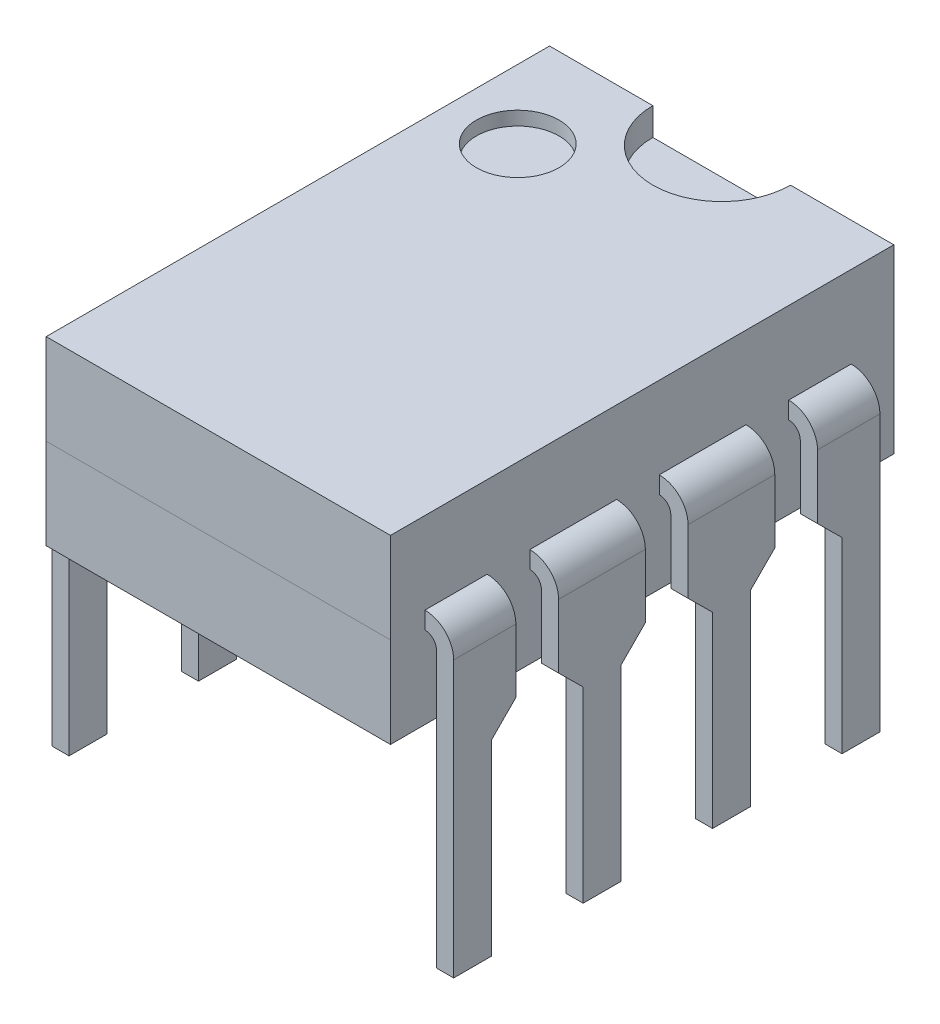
ISO-10303-21;
HEADER;
FILE_DESCRIPTION(('STEP AP214'),'2;1');
FILE_NAME('part.step','',(''),(''),'','','');
FILE_SCHEMA(('AUTOMOTIVE_DESIGN { 1 0 10303 214 1 1 1 1 }'));
ENDSEC;
DATA;
#1=APPLICATION_CONTEXT('core data for automotive mechanical design processes');
#2=APPLICATION_PROTOCOL_DEFINITION('international standard','automotive_design',2000,#1);
#3=PRODUCT_CONTEXT('',#1,'mechanical');
#4=PRODUCT('Part','Part','',(#3));
#5=PRODUCT_RELATED_PRODUCT_CATEGORY('part','',(#4));
#6=PRODUCT_DEFINITION_FORMATION('','',#4);
#7=PRODUCT_DEFINITION_CONTEXT('part definition',#1,'design');
#8=PRODUCT_DEFINITION('design','',#6,#7);
#9=PRODUCT_DEFINITION_SHAPE('','',#8);
#10=(LENGTH_UNIT() NAMED_UNIT(*) SI_UNIT(.MILLI.,.METRE.));
#11=(NAMED_UNIT(*) PLANE_ANGLE_UNIT() SI_UNIT($,.RADIAN.));
#12=(NAMED_UNIT(*) SI_UNIT($,.STERADIAN.) SOLID_ANGLE_UNIT());
#13=UNCERTAINTY_MEASURE_WITH_UNIT(LENGTH_MEASURE(1.E-05),#10,'distance_accuracy_value','');
#14=(GEOMETRIC_REPRESENTATION_CONTEXT(3) GLOBAL_UNCERTAINTY_ASSIGNED_CONTEXT((#13)) GLOBAL_UNIT_ASSIGNED_CONTEXT((#10,
#11,#12)) REPRESENTATION_CONTEXT('',''));
#15=CARTESIAN_POINT('',(0.,0.,0.));
#16=DIRECTION('',(0.,0.,1.));
#17=DIRECTION('',(1.,0.,0.));
#18=AXIS2_PLACEMENT_3D('',#15,#16,#17);
#19=CARTESIAN_POINT('',(-3.17499999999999,-0.371913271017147,-0.315527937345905));
#20=DIRECTION('',(0.,0.,-1.));
#21=DIRECTION('',(1.,0.,0.));
#22=AXIS2_PLACEMENT_3D('',#19,#20,#21);
#23=CYLINDRICAL_SURFACE('',#22,0.530663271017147);
#24=CARTESIAN_POINT('',(-3.17499999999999,-0.371913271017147,-1.91572793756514));
#25=DIRECTION('',(0.,0.,-1.));
#26=DIRECTION('',(-1.,0.,0.));
#27=AXIS2_PLACEMENT_3D('',#24,#25,#26);
#28=CIRCLE('',#27,0.530663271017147);
#29=CARTESIAN_POINT('',(-3.70566327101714,-0.371913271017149,-1.91572793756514));
#30=VERTEX_POINT('',#29);
#31=CARTESIAN_POINT('',(-3.175,0.15875,-1.91572793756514));
#32=VERTEX_POINT('',#31);
#33=EDGE_CURVE('E587',#30,#32,#28,.T.);
#34=ORIENTED_EDGE('',*,*,#33,.F.);
#35=DIRECTION('',(0.,0.,1.));
#36=VECTOR('',#35,1.);
#37=CARTESIAN_POINT('',(-3.70566327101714,-0.371913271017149,-1.91572793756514));
#38=LINE('',#37,#36);
#39=CARTESIAN_POINT('',(-3.70566327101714,-0.371913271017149,-0.315527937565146));
#40=VERTEX_POINT('',#39);
#41=EDGE_CURVE('E14',#30,#40,#38,.T.);
#42=ORIENTED_EDGE('',*,*,#41,.T.);
#43=CARTESIAN_POINT('',(-3.17499999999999,-0.371913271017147,-0.315527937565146));
#44=DIRECTION('',(0.,0.,-1.));
#45=DIRECTION('',(-1.,0.,0.));
#46=AXIS2_PLACEMENT_3D('',#43,#44,#45);
#47=CIRCLE('',#46,0.530663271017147);
#48=CARTESIAN_POINT('',(-3.175,0.15875,-0.315527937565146));
#49=VERTEX_POINT('',#48);
#50=EDGE_CURVE('E592',#49,#40,#47,.F.);
#51=ORIENTED_EDGE('',*,*,#50,.F.);
#52=DIRECTION('',(0.,0.,1.));
#53=VECTOR('',#52,1.);
#54=CARTESIAN_POINT('',(-3.175,0.15875,-0.315527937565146));
#55=LINE('',#54,#53);
#56=EDGE_CURVE('E583',#32,#49,#55,.T.);
#57=ORIENTED_EDGE('',*,*,#56,.F.);
#58=EDGE_LOOP('',(#34,#42,#51,#57));
#59=FACE_BOUND('',#58,.T.);
#60=ADVANCED_FACE('F476',(#59),#23,.T.);
#61=CARTESIAN_POINT('',(-3.38816327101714,0.212286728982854,-1.91572793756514));
#62=DIRECTION('',(1.,0.,0.));
#63=DIRECTION('',(0.,0.,-1.));
#64=AXIS2_PLACEMENT_3D('',#61,#62,#63);
#65=PLANE('',#64);
#66=DIRECTION('',(0.,1.,0.));
#67=VECTOR('',#66,1.);
#68=CARTESIAN_POINT('',(-3.38816327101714,0.212286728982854,-1.91572793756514));
#69=LINE('',#68,#67);
#70=CARTESIAN_POINT('',(-3.38816327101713,-1.5446912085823,-1.91572793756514));
#71=VERTEX_POINT('',#70);
#72=CARTESIAN_POINT('',(-3.38816327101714,-0.371913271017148,-1.91572793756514));
#73=VERTEX_POINT('',#72);
#74=EDGE_CURVE('E486',#71,#73,#69,.T.);
#75=ORIENTED_EDGE('',*,*,#74,.T.);
#76=DIRECTION('',(0.,0.,1.));
#77=VECTOR('',#76,1.);
#78=CARTESIAN_POINT('',(-3.38816327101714,-0.371913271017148,-1.91572793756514));
#79=LINE('',#78,#77);
#80=CARTESIAN_POINT('',(-3.38816327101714,-0.371913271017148,-0.315527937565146));
#81=VERTEX_POINT('',#80);
#82=EDGE_CURVE('E574',#73,#81,#79,.T.);
#83=ORIENTED_EDGE('',*,*,#82,.T.);
#84=DIRECTION('',(0.,-1.,0.));
#85=VECTOR('',#84,1.);
#86=CARTESIAN_POINT('',(-3.38816327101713,-1.548635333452,-0.315527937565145));
#87=LINE('',#86,#85);
#88=CARTESIAN_POINT('',(-3.38816327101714,-1.548635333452,-0.315527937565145));
#89=VERTEX_POINT('',#88);
#90=EDGE_CURVE('E576',#81,#89,#87,.T.);
#91=ORIENTED_EDGE('',*,*,#90,.T.);
#92=DIRECTION('',(0.,-0.704007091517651,-0.710192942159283));
#93=VECTOR('',#92,1.);
#94=CARTESIAN_POINT('',(-3.38816327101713,-1.99751327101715,-0.76835));
#95=LINE('',#94,#93);
#96=CARTESIAN_POINT('',(-3.38816327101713,-1.99751327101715,-0.768349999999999));
#97=VERTEX_POINT('',#96);
#98=EDGE_CURVE('E641',#89,#97,#95,.T.);
#99=ORIENTED_EDGE('',*,*,#98,.T.);
#100=DIRECTION('',(0.,-1.,0.));
#101=VECTOR('',#100,1.);
#102=CARTESIAN_POINT('',(-3.38816327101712,-5.45191327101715,-0.768349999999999));
#103=LINE('',#102,#101);
#104=CARTESIAN_POINT('',(-3.38816327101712,-5.45191327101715,-0.768349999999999));
#105=VERTEX_POINT('',#104);
#106=EDGE_CURVE('E644',#97,#105,#103,.T.);
#107=ORIENTED_EDGE('',*,*,#106,.T.);
#108=DIRECTION('',(0.,0.,-1.));
#109=VECTOR('',#108,1.);
#110=CARTESIAN_POINT('',(-3.38816327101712,-5.45191327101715,-1.46684999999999));
#111=LINE('',#110,#109);
#112=CARTESIAN_POINT('',(-3.38816327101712,-5.45191327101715,-1.46684999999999));
#113=VERTEX_POINT('',#112);
#114=EDGE_CURVE('E649',#105,#113,#111,.T.);
#115=ORIENTED_EDGE('',*,*,#114,.T.);
#116=DIRECTION('',(0.,1.,0.));
#117=VECTOR('',#116,1.);
#118=CARTESIAN_POINT('',(-3.38816327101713,-1.99751327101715,-1.46684999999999));
#119=LINE('',#118,#117);
#120=CARTESIAN_POINT('',(-3.38816327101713,-1.99751327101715,-1.46684999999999));
#121=VERTEX_POINT('',#120);
#122=EDGE_CURVE('E568',#113,#121,#119,.T.);
#123=ORIENTED_EDGE('',*,*,#122,.T.);
#124=DIRECTION('',(0.,0.710192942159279,-0.704007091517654));
#125=VECTOR('',#124,1.);
#126=CARTESIAN_POINT('',(-3.38816327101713,-1.5446912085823,-1.91572793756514));
#127=LINE('',#126,#125);
#128=EDGE_CURVE('E557',#121,#71,#127,.T.);
#129=ORIENTED_EDGE('',*,*,#128,.T.);
#130=EDGE_LOOP('',(#75,#83,#91,#99,#107,#115,#123,#129));
#131=FACE_BOUND('',#130,.T.);
#132=ADVANCED_FACE('F564',(#131),#65,.T.);
#133=CARTESIAN_POINT('',(-3.70566327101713,-1.548635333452,-0.315527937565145));
#134=DIRECTION('',(0.,0.,1.));
#135=DIRECTION('',(0.,1.,0.));
#136=AXIS2_PLACEMENT_3D('',#133,#134,#135);
#137=PLANE('',#136);
#138=ORIENTED_EDGE('',*,*,#90,.F.);
#139=CARTESIAN_POINT('',(-3.17499999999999,-0.371913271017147,-0.315527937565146));
#140=DIRECTION('',(0.,0.,-1.));
#141=DIRECTION('',(-1.,0.,0.));
#142=AXIS2_PLACEMENT_3D('',#139,#140,#141);
#143=CIRCLE('',#142,0.213163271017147);
#144=CARTESIAN_POINT('',(-3.175,-0.15875,-0.315527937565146));
#145=VERTEX_POINT('',#144);
#146=EDGE_CURVE('E480',#145,#81,#143,.F.);
#147=ORIENTED_EDGE('',*,*,#146,.F.);
#148=DIRECTION('',(0.,-1.,0.));
#149=VECTOR('',#148,1.);
#150=CARTESIAN_POINT('',(-3.175,0.15875,-0.315527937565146));
#151=LINE('',#150,#149);
#152=EDGE_CURVE('E586',#49,#145,#151,.T.);
#153=ORIENTED_EDGE('',*,*,#152,.F.);
#154=ORIENTED_EDGE('',*,*,#50,.T.);
#155=DIRECTION('',(0.,-1.,0.));
#156=VECTOR('',#155,1.);
#157=CARTESIAN_POINT('',(-3.70566327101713,-1.548635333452,-0.315527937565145));
#158=LINE('',#157,#156);
#159=CARTESIAN_POINT('',(-3.70566327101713,-1.548635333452,-0.315527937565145));
#160=VERTEX_POINT('',#159);
#161=EDGE_CURVE('E569',#40,#160,#158,.T.);
#162=ORIENTED_EDGE('',*,*,#161,.T.);
#163=DIRECTION('',(1.,0.,0.));
#164=VECTOR('',#163,1.);
#165=CARTESIAN_POINT('',(-3.70566327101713,-1.548635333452,-0.315527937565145));
#166=LINE('',#165,#164);
#167=EDGE_CURVE('E611',#160,#89,#166,.T.);
#168=ORIENTED_EDGE('',*,*,#167,.T.);
#169=EDGE_LOOP('',(#138,#147,#153,#154,#162,#168));
#170=FACE_BOUND('',#169,.T.);
#171=ADVANCED_FACE('F602',(#170),#137,.T.);
#172=CARTESIAN_POINT('',(-3.70566327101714,0.212286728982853,-1.91572793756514));
#173=DIRECTION('',(0.,0.,-1.));
#174=DIRECTION('',(0.,-1.,0.));
#175=AXIS2_PLACEMENT_3D('',#172,#173,#174);
#176=PLANE('',#175);
#177=DIRECTION('',(0.,1.,0.));
#178=VECTOR('',#177,1.);
#179=CARTESIAN_POINT('',(-3.70566327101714,0.212286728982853,-1.91572793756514));
#180=LINE('',#179,#178);
#181=CARTESIAN_POINT('',(-3.70566327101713,-1.5446912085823,-1.91572793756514));
#182=VERTEX_POINT('',#181);
#183=EDGE_CURVE('E495',#182,#30,#180,.T.);
#184=ORIENTED_EDGE('',*,*,#183,.T.);
#185=ORIENTED_EDGE('',*,*,#33,.T.);
#186=DIRECTION('',(0.,-1.,0.));
#187=VECTOR('',#186,1.);
#188=CARTESIAN_POINT('',(-3.175,0.15875,-1.91572793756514));
#189=LINE('',#188,#187);
#190=CARTESIAN_POINT('',(-3.175,-0.15875,-1.91572793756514));
#191=VERTEX_POINT('',#190);
#192=EDGE_CURVE('E591',#32,#191,#189,.T.);
#193=ORIENTED_EDGE('',*,*,#192,.T.);
#194=CARTESIAN_POINT('',(-3.17499999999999,-0.371913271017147,-1.91572793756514));
#195=DIRECTION('',(0.,0.,-1.));
#196=DIRECTION('',(-1.,0.,0.));
#197=AXIS2_PLACEMENT_3D('',#194,#195,#196);
#198=CIRCLE('',#197,0.213163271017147);
#199=EDGE_CURVE('E573',#73,#191,#198,.T.);
#200=ORIENTED_EDGE('',*,*,#199,.F.);
#201=ORIENTED_EDGE('',*,*,#74,.F.);
#202=DIRECTION('',(1.,0.,0.));
#203=VECTOR('',#202,1.);
#204=CARTESIAN_POINT('',(-3.70566327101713,-1.5446912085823,-1.91572793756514));
#205=LINE('',#204,#203);
#206=EDGE_CURVE('E527',#182,#71,#205,.T.);
#207=ORIENTED_EDGE('',*,*,#206,.F.);
#208=EDGE_LOOP('',(#184,#185,#193,#200,#201,#207));
#209=FACE_BOUND('',#208,.T.);
#210=ADVANCED_FACE('F571',(#209),#176,.T.);
#211=CARTESIAN_POINT('',(-3.17499999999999,0.,-1.91572793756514));
#212=DIRECTION('',(-1.,0.,0.));
#213=DIRECTION('',(0.,0.,1.));
#214=AXIS2_PLACEMENT_3D('',#211,#212,#213);
#215=PLANE('',#214);
#216=ORIENTED_EDGE('',*,*,#152,.T.);
#217=DIRECTION('',(0.,0.,1.));
#218=VECTOR('',#217,1.);
#219=CARTESIAN_POINT('',(-3.175,-0.15875,-0.315527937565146));
#220=LINE('',#219,#218);
#221=EDGE_CURVE('E581',#191,#145,#220,.T.);
#222=ORIENTED_EDGE('',*,*,#221,.F.);
#223=ORIENTED_EDGE('',*,*,#192,.F.);
#224=ORIENTED_EDGE('',*,*,#56,.T.);
#225=EDGE_LOOP('',(#216,#222,#223,#224));
#226=FACE_BOUND('',#225,.T.);
#227=ADVANCED_FACE('F601',(#226),#215,.F.);
#228=CARTESIAN_POINT('',(-3.70566327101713,-1.5446912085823,-1.91572793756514));
#229=DIRECTION('',(0.,-0.704007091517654,-0.710192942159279));
#230=DIRECTION('',(0.,-0.710192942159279,0.704007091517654));
#231=AXIS2_PLACEMENT_3D('',#228,#229,#230);
#232=PLANE('',#231);
#233=ORIENTED_EDGE('',*,*,#128,.F.);
#234=DIRECTION('',(1.,0.,0.));
#235=VECTOR('',#234,1.);
#236=CARTESIAN_POINT('',(-3.70566327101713,-1.99751327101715,-1.46684999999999));
#237=LINE('',#236,#235);
#238=CARTESIAN_POINT('',(-3.70566327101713,-1.99751327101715,-1.46684999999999));
#239=VERTEX_POINT('',#238);
#240=EDGE_CURVE('E551',#239,#121,#237,.T.);
#241=ORIENTED_EDGE('',*,*,#240,.F.);
#242=DIRECTION('',(0.,0.710192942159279,-0.704007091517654));
#243=VECTOR('',#242,1.);
#244=CARTESIAN_POINT('',(-3.70566327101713,-1.5446912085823,-1.91572793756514));
#245=LINE('',#244,#243);
#246=EDGE_CURVE('E559',#239,#182,#245,.T.);
#247=ORIENTED_EDGE('',*,*,#246,.T.);
#248=ORIENTED_EDGE('',*,*,#206,.T.);
#249=EDGE_LOOP('',(#233,#241,#247,#248));
#250=FACE_BOUND('',#249,.T.);
#251=ADVANCED_FACE('F556',(#250),#232,.T.);
#252=CARTESIAN_POINT('',(-3.70566327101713,-1.99751327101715,-1.46684999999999));
#253=DIRECTION('',(0.,0.,-1.));
#254=DIRECTION('',(0.,-1.,0.));
#255=AXIS2_PLACEMENT_3D('',#252,#253,#254);
#256=PLANE('',#255);
#257=ORIENTED_EDGE('',*,*,#122,.F.);
#258=DIRECTION('',(1.,0.,0.));
#259=VECTOR('',#258,1.);
#260=CARTESIAN_POINT('',(-3.70566327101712,-5.45191327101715,-1.46684999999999));
#261=LINE('',#260,#259);
#262=CARTESIAN_POINT('',(-3.70566327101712,-5.45191327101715,-1.46684999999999));
#263=VERTEX_POINT('',#262);
#264=EDGE_CURVE('E624',#263,#113,#261,.T.);
#265=ORIENTED_EDGE('',*,*,#264,.F.);
#266=DIRECTION('',(0.,1.,0.));
#267=VECTOR('',#266,1.);
#268=CARTESIAN_POINT('',(-3.70566327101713,-1.99751327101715,-1.46684999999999));
#269=LINE('',#268,#267);
#270=EDGE_CURVE('E560',#263,#239,#269,.T.);
#271=ORIENTED_EDGE('',*,*,#270,.T.);
#272=ORIENTED_EDGE('',*,*,#240,.T.);
#273=EDGE_LOOP('',(#257,#265,#271,#272));
#274=FACE_BOUND('',#273,.T.);
#275=ADVANCED_FACE('F662',(#274),#256,.T.);
#276=CARTESIAN_POINT('',(-3.70566327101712,-5.45191327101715,-1.46684999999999));
#277=DIRECTION('',(0.,-1.,0.));
#278=DIRECTION('',(0.,0.,1.));
#279=AXIS2_PLACEMENT_3D('',#276,#277,#278);
#280=PLANE('',#279);
#281=ORIENTED_EDGE('',*,*,#114,.F.);
#282=DIRECTION('',(1.,0.,0.));
#283=VECTOR('',#282,1.);
#284=CARTESIAN_POINT('',(-3.70566327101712,-5.45191327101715,-0.768349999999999));
#285=LINE('',#284,#283);
#286=CARTESIAN_POINT('',(-3.70566327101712,-5.45191327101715,-0.768349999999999));
#287=VERTEX_POINT('',#286);
#288=EDGE_CURVE('E618',#287,#105,#285,.T.);
#289=ORIENTED_EDGE('',*,*,#288,.F.);
#290=DIRECTION('',(0.,0.,-1.));
#291=VECTOR('',#290,1.);
#292=CARTESIAN_POINT('',(-3.70566327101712,-5.45191327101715,-1.46684999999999));
#293=LINE('',#292,#291);
#294=EDGE_CURVE('E627',#287,#263,#293,.T.);
#295=ORIENTED_EDGE('',*,*,#294,.T.);
#296=ORIENTED_EDGE('',*,*,#264,.T.);
#297=EDGE_LOOP('',(#281,#289,#295,#296));
#298=FACE_BOUND('',#297,.T.);
#299=ADVANCED_FACE('F668',(#298),#280,.T.);
#300=CARTESIAN_POINT('',(-3.70566327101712,-5.45191327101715,-0.768349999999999));
#301=DIRECTION('',(0.,0.,1.));
#302=DIRECTION('',(0.,1.,0.));
#303=AXIS2_PLACEMENT_3D('',#300,#301,#302);
#304=PLANE('',#303);
#305=ORIENTED_EDGE('',*,*,#106,.F.);
#306=DIRECTION('',(1.,0.,0.));
#307=VECTOR('',#306,1.);
#308=CARTESIAN_POINT('',(-3.70566327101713,-1.99751327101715,-0.76835));
#309=LINE('',#308,#307);
#310=CARTESIAN_POINT('',(-3.70566327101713,-1.99751327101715,-0.76835));
#311=VERTEX_POINT('',#310);
#312=EDGE_CURVE('E593',#311,#97,#309,.T.);
#313=ORIENTED_EDGE('',*,*,#312,.F.);
#314=DIRECTION('',(0.,-1.,0.));
#315=VECTOR('',#314,1.);
#316=CARTESIAN_POINT('',(-3.70566327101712,-5.45191327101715,-0.768349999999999));
#317=LINE('',#316,#315);
#318=EDGE_CURVE('E621',#311,#287,#317,.T.);
#319=ORIENTED_EDGE('',*,*,#318,.T.);
#320=ORIENTED_EDGE('',*,*,#288,.T.);
#321=EDGE_LOOP('',(#305,#313,#319,#320));
#322=FACE_BOUND('',#321,.T.);
#323=ADVANCED_FACE('F688',(#322),#304,.T.);
#324=CARTESIAN_POINT('',(-3.70566327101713,-1.99751327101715,-0.76835));
#325=DIRECTION('',(0.,-0.710192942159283,0.704007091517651));
#326=DIRECTION('',(0.,0.704007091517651,0.710192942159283));
#327=AXIS2_PLACEMENT_3D('',#324,#325,#326);
#328=PLANE('',#327);
#329=ORIENTED_EDGE('',*,*,#98,.F.);
#330=ORIENTED_EDGE('',*,*,#167,.F.);
#331=DIRECTION('',(0.,-0.704007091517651,-0.710192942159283));
#332=VECTOR('',#331,1.);
#333=CARTESIAN_POINT('',(-3.70566327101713,-1.99751327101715,-0.76835));
#334=LINE('',#333,#332);
#335=EDGE_CURVE('E610',#160,#311,#334,.T.);
#336=ORIENTED_EDGE('',*,*,#335,.T.);
#337=ORIENTED_EDGE('',*,*,#312,.T.);
#338=EDGE_LOOP('',(#329,#330,#336,#337));
#339=FACE_BOUND('',#338,.T.);
#340=ADVANCED_FACE('F685',(#339),#328,.T.);
#341=CARTESIAN_POINT('',(-3.17499999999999,-0.371913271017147,-0.315527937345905));
#342=DIRECTION('',(0.,0.,-1.));
#343=DIRECTION('',(1.,0.,0.));
#344=AXIS2_PLACEMENT_3D('',#341,#342,#343);
#345=CYLINDRICAL_SURFACE('',#344,0.213163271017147);
#346=ORIENTED_EDGE('',*,*,#82,.F.);
#347=ORIENTED_EDGE('',*,*,#199,.T.);
#348=ORIENTED_EDGE('',*,*,#221,.T.);
#349=ORIENTED_EDGE('',*,*,#146,.T.);
#350=EDGE_LOOP('',(#346,#347,#348,#349));
#351=FACE_BOUND('',#350,.T.);
#352=ADVANCED_FACE('F595',(#351),#345,.F.);
#353=CARTESIAN_POINT('',(-3.70566327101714,0.212286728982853,-1.91572793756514));
#354=DIRECTION('',(1.,0.,0.));
#355=DIRECTION('',(0.,0.,-1.));
#356=AXIS2_PLACEMENT_3D('',#353,#354,#355);
#357=PLANE('',#356);
#358=ORIENTED_EDGE('',*,*,#41,.F.);
#359=ORIENTED_EDGE('',*,*,#183,.F.);
#360=ORIENTED_EDGE('',*,*,#246,.F.);
#361=ORIENTED_EDGE('',*,*,#270,.F.);
#362=ORIENTED_EDGE('',*,*,#294,.F.);
#363=ORIENTED_EDGE('',*,*,#318,.F.);
#364=ORIENTED_EDGE('',*,*,#335,.F.);
#365=ORIENTED_EDGE('',*,*,#161,.F.);
#366=EDGE_LOOP('',(#358,#359,#360,#361,#362,#363,#364,#365));
#367=FACE_BOUND('',#366,.T.);
#368=ADVANCED_FACE('F478',(#367),#357,.F.);
#369=CLOSED_SHELL('',(#60,#132,#171,#210,#227,#251,#275,#299,#323,#340,#352,#368));
#370=MANIFOLD_SOLID_BREP('B2',#369);
#371=CARTESIAN_POINT('',(-3.17499999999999,-0.371913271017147,2.07207206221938));
#372=DIRECTION('',(0.,0.,-1.));
#373=DIRECTION('',(1.,0.,0.));
#374=AXIS2_PLACEMENT_3D('',#371,#372,#373);
#375=CYLINDRICAL_SURFACE('',#374,0.530663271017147);
#376=CARTESIAN_POINT('',(-3.17499999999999,-0.371913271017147,0.471872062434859));
#377=DIRECTION('',(0.,0.,-1.));
#378=DIRECTION('',(-1.,0.,0.));
#379=AXIS2_PLACEMENT_3D('',#376,#377,#378);
#380=CIRCLE('',#379,0.530663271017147);
#381=CARTESIAN_POINT('',(-3.70566327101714,-0.371913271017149,0.471872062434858));
#382=VERTEX_POINT('',#381);
#383=CARTESIAN_POINT('',(-3.175,0.15875,0.471872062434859));
#384=VERTEX_POINT('',#383);
#385=EDGE_CURVE('E928',#382,#384,#380,.T.);
#386=ORIENTED_EDGE('',*,*,#385,.F.);
#387=DIRECTION('',(0.,0.,1.));
#388=VECTOR('',#387,1.);
#389=CARTESIAN_POINT('',(-3.70566327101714,-0.371913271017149,0.47187206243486));
#390=LINE('',#389,#388);
#391=CARTESIAN_POINT('',(-3.70566327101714,-0.371913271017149,2.07207206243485));
#392=VERTEX_POINT('',#391);
#393=EDGE_CURVE('E474',#382,#392,#390,.T.);
#394=ORIENTED_EDGE('',*,*,#393,.T.);
#395=CARTESIAN_POINT('',(-3.17499999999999,-0.371913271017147,2.07207206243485));
#396=DIRECTION('',(0.,0.,-1.));
#397=DIRECTION('',(-1.,0.,0.));
#398=AXIS2_PLACEMENT_3D('',#395,#396,#397);
#399=CIRCLE('',#398,0.530663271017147);
#400=CARTESIAN_POINT('',(-3.175,0.15875,2.07207206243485));
#401=VERTEX_POINT('',#400);
#402=EDGE_CURVE('E922',#401,#392,#399,.F.);
#403=ORIENTED_EDGE('',*,*,#402,.F.);
#404=DIRECTION('',(0.,0.,1.));
#405=VECTOR('',#404,1.);
#406=CARTESIAN_POINT('',(-3.175,0.15875,2.07207206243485));
#407=LINE('',#406,#405);
#408=EDGE_CURVE('E925',#384,#401,#407,.T.);
#409=ORIENTED_EDGE('',*,*,#408,.F.);
#410=EDGE_LOOP('',(#386,#394,#403,#409));
#411=FACE_BOUND('',#410,.T.);
#412=ADVANCED_FACE('F838',(#411),#375,.T.);
#413=CARTESIAN_POINT('',(-3.38816327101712,-5.45191327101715,0.47187206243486));
#414=DIRECTION('',(1.,0.,0.));
#415=DIRECTION('',(0.,0.,-1.));
#416=AXIS2_PLACEMENT_3D('',#413,#414,#415);
#417=PLANE('',#416);
#418=DIRECTION('',(0.,1.,0.));
#419=VECTOR('',#418,1.);
#420=CARTESIAN_POINT('',(-3.38816327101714,0.212286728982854,0.471872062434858));
#421=LINE('',#420,#419);
#422=CARTESIAN_POINT('',(-3.38816327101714,-1.5446912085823,0.471872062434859));
#423=VERTEX_POINT('',#422);
#424=CARTESIAN_POINT('',(-3.38816327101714,-0.371913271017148,0.471872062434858));
#425=VERTEX_POINT('',#424);
#426=EDGE_CURVE('E848',#423,#425,#421,.T.);
#427=ORIENTED_EDGE('',*,*,#426,.T.);
#428=DIRECTION('',(0.,0.,1.));
#429=VECTOR('',#428,1.);
#430=CARTESIAN_POINT('',(-3.38816327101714,-0.371913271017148,0.47187206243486));
#431=LINE('',#430,#429);
#432=CARTESIAN_POINT('',(-3.38816327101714,-0.371913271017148,2.07207206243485));
#433=VERTEX_POINT('',#432);
#434=EDGE_CURVE('E957',#425,#433,#431,.T.);
#435=ORIENTED_EDGE('',*,*,#434,.T.);
#436=DIRECTION('',(0.,-1.,0.));
#437=VECTOR('',#436,1.);
#438=CARTESIAN_POINT('',(-3.38816327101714,-1.548635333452,2.07207206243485));
#439=LINE('',#438,#437);
#440=CARTESIAN_POINT('',(-3.38816327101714,-1.54863533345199,2.07207206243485));
#441=VERTEX_POINT('',#440);
#442=EDGE_CURVE('E954',#433,#441,#439,.T.);
#443=ORIENTED_EDGE('',*,*,#442,.T.);
#444=DIRECTION('',(0.,-0.704007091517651,-0.710192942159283));
#445=VECTOR('',#444,1.);
#446=CARTESIAN_POINT('',(-3.38816327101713,-1.99751327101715,1.61925));
#447=LINE('',#446,#445);
#448=CARTESIAN_POINT('',(-3.38816327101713,-1.99751327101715,1.61925));
#449=VERTEX_POINT('',#448);
#450=EDGE_CURVE('E958',#441,#449,#447,.T.);
#451=ORIENTED_EDGE('',*,*,#450,.T.);
#452=DIRECTION('',(0.,-1.,0.));
#453=VECTOR('',#452,1.);
#454=CARTESIAN_POINT('',(-3.38816327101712,-5.45191327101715,1.61925));
#455=LINE('',#454,#453);
#456=CARTESIAN_POINT('',(-3.38816327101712,-5.45191327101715,1.61925));
#457=VERTEX_POINT('',#456);
#458=EDGE_CURVE('E961',#449,#457,#455,.T.);
#459=ORIENTED_EDGE('',*,*,#458,.T.);
#460=DIRECTION('',(0.,0.,-1.));
#461=VECTOR('',#460,1.);
#462=CARTESIAN_POINT('',(-3.38816327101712,-5.45191327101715,0.920750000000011));
#463=LINE('',#462,#461);
#464=CARTESIAN_POINT('',(-3.38816327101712,-5.45191327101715,0.920750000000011));
#465=VERTEX_POINT('',#464);
#466=EDGE_CURVE('E966',#457,#465,#463,.T.);
#467=ORIENTED_EDGE('',*,*,#466,.T.);
#468=DIRECTION('',(0.,1.,0.));
#469=VECTOR('',#468,1.);
#470=CARTESIAN_POINT('',(-3.38816327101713,-1.99751327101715,0.92075000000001));
#471=LINE('',#470,#469);
#472=CARTESIAN_POINT('',(-3.38816327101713,-1.99751327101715,0.92075000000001));
#473=VERTEX_POINT('',#472);
#474=EDGE_CURVE('E971',#465,#473,#471,.T.);
#475=ORIENTED_EDGE('',*,*,#474,.T.);
#476=DIRECTION('',(0.,0.710192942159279,-0.704007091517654));
#477=VECTOR('',#476,1.);
#478=CARTESIAN_POINT('',(-3.38816327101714,-1.5446912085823,0.471872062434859));
#479=LINE('',#478,#477);
#480=EDGE_CURVE('E976',#473,#423,#479,.T.);
#481=ORIENTED_EDGE('',*,*,#480,.T.);
#482=EDGE_LOOP('',(#427,#435,#443,#451,#459,#467,#475,#481));
#483=FACE_BOUND('',#482,.T.);
#484=ADVANCED_FACE('F1040',(#483),#417,.T.);
#485=CARTESIAN_POINT('',(-3.70566327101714,0.212286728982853,0.471872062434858));
#486=DIRECTION('',(0.,0.,-1.));
#487=DIRECTION('',(0.,-1.,0.));
#488=AXIS2_PLACEMENT_3D('',#485,#486,#487);
#489=PLANE('',#488);
#490=DIRECTION('',(0.,1.,0.));
#491=VECTOR('',#490,1.);
#492=CARTESIAN_POINT('',(-3.70566327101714,0.212286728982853,0.471872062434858));
#493=LINE('',#492,#491);
#494=CARTESIAN_POINT('',(-3.70566327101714,-1.5446912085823,0.471872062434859));
#495=VERTEX_POINT('',#494);
#496=EDGE_CURVE('E857',#495,#382,#493,.T.);
#497=ORIENTED_EDGE('',*,*,#496,.T.);
#498=ORIENTED_EDGE('',*,*,#385,.T.);
#499=DIRECTION('',(0.,-1.,0.));
#500=VECTOR('',#499,1.);
#501=CARTESIAN_POINT('',(-3.175,0.15875,0.471872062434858));
#502=LINE('',#501,#500);
#503=CARTESIAN_POINT('',(-3.175,-0.15875,0.471872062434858));
#504=VERTEX_POINT('',#503);
#505=EDGE_CURVE('E935',#384,#504,#502,.T.);
#506=ORIENTED_EDGE('',*,*,#505,.T.);
#507=CARTESIAN_POINT('',(-3.17499999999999,-0.371913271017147,0.471872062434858));
#508=DIRECTION('',(0.,0.,-1.));
#509=DIRECTION('',(-1.,0.,0.));
#510=AXIS2_PLACEMENT_3D('',#507,#508,#509);
#511=CIRCLE('',#510,0.213163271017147);
#512=EDGE_CURVE('E944',#425,#504,#511,.T.);
#513=ORIENTED_EDGE('',*,*,#512,.F.);
#514=ORIENTED_EDGE('',*,*,#426,.F.);
#515=DIRECTION('',(1.,0.,0.));
#516=VECTOR('',#515,1.);
#517=CARTESIAN_POINT('',(-3.70566327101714,-1.5446912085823,0.471872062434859));
#518=LINE('',#517,#516);
#519=EDGE_CURVE('E988',#495,#423,#518,.T.);
#520=ORIENTED_EDGE('',*,*,#519,.F.);
#521=EDGE_LOOP('',(#497,#498,#506,#513,#514,#520));
#522=FACE_BOUND('',#521,.T.);
#523=ADVANCED_FACE('F1038',(#522),#489,.T.);
#524=CARTESIAN_POINT('',(-3.70566327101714,-1.548635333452,2.07207206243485));
#525=DIRECTION('',(0.,0.,1.));
#526=DIRECTION('',(0.,1.,0.));
#527=AXIS2_PLACEMENT_3D('',#524,#525,#526);
#528=PLANE('',#527);
#529=ORIENTED_EDGE('',*,*,#442,.F.);
#530=CARTESIAN_POINT('',(-3.17499999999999,-0.371913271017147,2.07207206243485));
#531=DIRECTION('',(0.,0.,-1.));
#532=DIRECTION('',(-1.,0.,0.));
#533=AXIS2_PLACEMENT_3D('',#530,#531,#532);
#534=CIRCLE('',#533,0.213163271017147);
#535=CARTESIAN_POINT('',(-3.175,-0.15875,2.07207206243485));
#536=VERTEX_POINT('',#535);
#537=EDGE_CURVE('E842',#536,#433,#534,.F.);
#538=ORIENTED_EDGE('',*,*,#537,.F.);
#539=DIRECTION('',(0.,-1.,0.));
#540=VECTOR('',#539,1.);
#541=CARTESIAN_POINT('',(-3.175,0.15875,2.07207206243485));
#542=LINE('',#541,#540);
#543=EDGE_CURVE('E933',#401,#536,#542,.T.);
#544=ORIENTED_EDGE('',*,*,#543,.F.);
#545=ORIENTED_EDGE('',*,*,#402,.T.);
#546=DIRECTION('',(0.,-1.,0.));
#547=VECTOR('',#546,1.);
#548=CARTESIAN_POINT('',(-3.70566327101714,-1.548635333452,2.07207206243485));
#549=LINE('',#548,#547);
#550=CARTESIAN_POINT('',(-3.70566327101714,-1.548635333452,2.07207206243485));
#551=VERTEX_POINT('',#550);
#552=EDGE_CURVE('E940',#392,#551,#549,.T.);
#553=ORIENTED_EDGE('',*,*,#552,.T.);
#554=DIRECTION('',(1.,0.,0.));
#555=VECTOR('',#554,1.);
#556=CARTESIAN_POINT('',(-3.70566327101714,-1.548635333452,2.07207206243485));
#557=LINE('',#556,#555);
#558=EDGE_CURVE('E888',#551,#441,#557,.T.);
#559=ORIENTED_EDGE('',*,*,#558,.T.);
#560=EDGE_LOOP('',(#529,#538,#544,#545,#553,#559));
#561=FACE_BOUND('',#560,.T.);
#562=ADVANCED_FACE('F938',(#561),#528,.T.);
#563=CARTESIAN_POINT('',(-3.17499999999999,0.,-1.91572793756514));
#564=DIRECTION('',(-1.,0.,0.));
#565=DIRECTION('',(0.,0.,1.));
#566=AXIS2_PLACEMENT_3D('',#563,#564,#565);
#567=PLANE('',#566);
#568=ORIENTED_EDGE('',*,*,#543,.T.);
#569=DIRECTION('',(0.,0.,1.));
#570=VECTOR('',#569,1.);
#571=CARTESIAN_POINT('',(-3.175,-0.15875,2.07207206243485));
#572=LINE('',#571,#570);
#573=EDGE_CURVE('E946',#504,#536,#572,.T.);
#574=ORIENTED_EDGE('',*,*,#573,.F.);
#575=ORIENTED_EDGE('',*,*,#505,.F.);
#576=ORIENTED_EDGE('',*,*,#408,.T.);
#577=EDGE_LOOP('',(#568,#574,#575,#576));
#578=FACE_BOUND('',#577,.T.);
#579=ADVANCED_FACE('F932',(#578),#567,.F.);
#580=CARTESIAN_POINT('',(-3.70566327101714,-1.5446912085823,0.471872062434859));
#581=DIRECTION('',(0.,-0.704007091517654,-0.710192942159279));
#582=DIRECTION('',(0.,-0.710192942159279,0.704007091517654));
#583=AXIS2_PLACEMENT_3D('',#580,#581,#582);
#584=PLANE('',#583);
#585=ORIENTED_EDGE('',*,*,#480,.F.);
#586=DIRECTION('',(1.,0.,0.));
#587=VECTOR('',#586,1.);
#588=CARTESIAN_POINT('',(-3.70566327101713,-1.99751327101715,0.92075000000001));
#589=LINE('',#588,#587);
#590=CARTESIAN_POINT('',(-3.70566327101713,-1.99751327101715,0.92075000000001));
#591=VERTEX_POINT('',#590);
#592=EDGE_CURVE('E993',#591,#473,#589,.T.);
#593=ORIENTED_EDGE('',*,*,#592,.F.);
#594=DIRECTION('',(0.,0.710192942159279,-0.704007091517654));
#595=VECTOR('',#594,1.);
#596=CARTESIAN_POINT('',(-3.70566327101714,-1.5446912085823,0.471872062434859));
#597=LINE('',#596,#595);
#598=EDGE_CURVE('E936',#591,#495,#597,.T.);
#599=ORIENTED_EDGE('',*,*,#598,.T.);
#600=ORIENTED_EDGE('',*,*,#519,.T.);
#601=EDGE_LOOP('',(#585,#593,#599,#600));
#602=FACE_BOUND('',#601,.T.);
#603=ADVANCED_FACE('F1034',(#602),#584,.T.);
#604=CARTESIAN_POINT('',(-3.70566327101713,-1.99751327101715,0.92075000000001));
#605=DIRECTION('',(0.,0.,-1.));
#606=DIRECTION('',(0.,-1.,0.));
#607=AXIS2_PLACEMENT_3D('',#604,#605,#606);
#608=PLANE('',#607);
#609=ORIENTED_EDGE('',*,*,#474,.F.);
#610=DIRECTION('',(1.,0.,0.));
#611=VECTOR('',#610,1.);
#612=CARTESIAN_POINT('',(-3.70566327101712,-5.45191327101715,0.920750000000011));
#613=LINE('',#612,#611);
#614=CARTESIAN_POINT('',(-3.70566327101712,-5.45191327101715,0.920750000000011));
#615=VERTEX_POINT('',#614);
#616=EDGE_CURVE('E998',#615,#465,#613,.T.);
#617=ORIENTED_EDGE('',*,*,#616,.F.);
#618=DIRECTION('',(0.,1.,0.));
#619=VECTOR('',#618,1.);
#620=CARTESIAN_POINT('',(-3.70566327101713,-1.99751327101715,0.92075000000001));
#621=LINE('',#620,#619);
#622=EDGE_CURVE('E990',#615,#591,#621,.T.);
#623=ORIENTED_EDGE('',*,*,#622,.T.);
#624=ORIENTED_EDGE('',*,*,#592,.T.);
#625=EDGE_LOOP('',(#609,#617,#623,#624));
#626=FACE_BOUND('',#625,.T.);
#627=ADVANCED_FACE('F1106',(#626),#608,.T.);
#628=CARTESIAN_POINT('',(-3.70566327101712,-5.45191327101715,0.920750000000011));
#629=DIRECTION('',(0.,-1.,0.));
#630=DIRECTION('',(0.,0.,1.));
#631=AXIS2_PLACEMENT_3D('',#628,#629,#630);
#632=PLANE('',#631);
#633=ORIENTED_EDGE('',*,*,#466,.F.);
#634=DIRECTION('',(1.,0.,0.));
#635=VECTOR('',#634,1.);
#636=CARTESIAN_POINT('',(-3.70566327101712,-5.45191327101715,1.61925));
#637=LINE('',#636,#635);
#638=CARTESIAN_POINT('',(-3.70566327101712,-5.45191327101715,1.61925));
#639=VERTEX_POINT('',#638);
#640=EDGE_CURVE('E1003',#639,#457,#637,.T.);
#641=ORIENTED_EDGE('',*,*,#640,.F.);
#642=DIRECTION('',(0.,0.,-1.));
#643=VECTOR('',#642,1.);
#644=CARTESIAN_POINT('',(-3.70566327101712,-5.45191327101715,0.920750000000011));
#645=LINE('',#644,#643);
#646=EDGE_CURVE('E995',#639,#615,#645,.T.);
#647=ORIENTED_EDGE('',*,*,#646,.T.);
#648=ORIENTED_EDGE('',*,*,#616,.T.);
#649=EDGE_LOOP('',(#633,#641,#647,#648));
#650=FACE_BOUND('',#649,.T.);
#651=ADVANCED_FACE('F1096',(#650),#632,.T.);
#652=CARTESIAN_POINT('',(-3.70566327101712,-5.45191327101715,1.61925));
#653=DIRECTION('',(0.,0.,1.));
#654=DIRECTION('',(0.,1.,0.));
#655=AXIS2_PLACEMENT_3D('',#652,#653,#654);
#656=PLANE('',#655);
#657=ORIENTED_EDGE('',*,*,#458,.F.);
#658=DIRECTION('',(1.,0.,0.));
#659=VECTOR('',#658,1.);
#660=CARTESIAN_POINT('',(-3.70566327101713,-1.99751327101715,1.61925));
#661=LINE('',#660,#659);
#662=CARTESIAN_POINT('',(-3.70566327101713,-1.99751327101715,1.61925));
#663=VERTEX_POINT('',#662);
#664=EDGE_CURVE('E927',#663,#449,#661,.T.);
#665=ORIENTED_EDGE('',*,*,#664,.F.);
#666=DIRECTION('',(0.,-1.,0.));
#667=VECTOR('',#666,1.);
#668=CARTESIAN_POINT('',(-3.70566327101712,-5.45191327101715,1.61925));
#669=LINE('',#668,#667);
#670=EDGE_CURVE('E1000',#663,#639,#669,.T.);
#671=ORIENTED_EDGE('',*,*,#670,.T.);
#672=ORIENTED_EDGE('',*,*,#640,.T.);
#673=EDGE_LOOP('',(#657,#665,#671,#672));
#674=FACE_BOUND('',#673,.T.);
#675=ADVANCED_FACE('F1087',(#674),#656,.T.);
#676=CARTESIAN_POINT('',(-3.70566327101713,-1.99751327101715,1.61925));
#677=DIRECTION('',(0.,-0.710192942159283,0.704007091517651));
#678=DIRECTION('',(0.,0.704007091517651,0.710192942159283));
#679=AXIS2_PLACEMENT_3D('',#676,#677,#678);
#680=PLANE('',#679);
#681=ORIENTED_EDGE('',*,*,#450,.F.);
#682=ORIENTED_EDGE('',*,*,#558,.F.);
#683=DIRECTION('',(0.,-0.704007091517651,-0.710192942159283));
#684=VECTOR('',#683,1.);
#685=CARTESIAN_POINT('',(-3.70566327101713,-1.99751327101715,1.61925));
#686=LINE('',#685,#684);
#687=EDGE_CURVE('E1005',#551,#663,#686,.T.);
#688=ORIENTED_EDGE('',*,*,#687,.T.);
#689=ORIENTED_EDGE('',*,*,#664,.T.);
#690=EDGE_LOOP('',(#681,#682,#688,#689));
#691=FACE_BOUND('',#690,.T.);
#692=ADVANCED_FACE('F1082',(#691),#680,.T.);
#693=CARTESIAN_POINT('',(-3.17499999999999,-0.371913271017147,2.07207206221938));
#694=DIRECTION('',(0.,0.,-1.));
#695=DIRECTION('',(1.,0.,0.));
#696=AXIS2_PLACEMENT_3D('',#693,#694,#695);
#697=CYLINDRICAL_SURFACE('',#696,0.213163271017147);
#698=ORIENTED_EDGE('',*,*,#434,.F.);
#699=ORIENTED_EDGE('',*,*,#512,.T.);
#700=ORIENTED_EDGE('',*,*,#573,.T.);
#701=ORIENTED_EDGE('',*,*,#537,.T.);
#702=EDGE_LOOP('',(#698,#699,#700,#701));
#703=FACE_BOUND('',#702,.T.);
#704=ADVANCED_FACE('F1070',(#703),#697,.F.);
#705=CARTESIAN_POINT('',(-3.70566327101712,-5.45191327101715,0.47187206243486));
#706=DIRECTION('',(1.,0.,0.));
#707=DIRECTION('',(0.,0.,-1.));
#708=AXIS2_PLACEMENT_3D('',#705,#706,#707);
#709=PLANE('',#708);
#710=ORIENTED_EDGE('',*,*,#393,.F.);
#711=ORIENTED_EDGE('',*,*,#496,.F.);
#712=ORIENTED_EDGE('',*,*,#598,.F.);
#713=ORIENTED_EDGE('',*,*,#622,.F.);
#714=ORIENTED_EDGE('',*,*,#646,.F.);
#715=ORIENTED_EDGE('',*,*,#670,.F.);
#716=ORIENTED_EDGE('',*,*,#687,.F.);
#717=ORIENTED_EDGE('',*,*,#552,.F.);
#718=EDGE_LOOP('',(#710,#711,#712,#713,#714,#715,#716,#717));
#719=FACE_BOUND('',#718,.T.);
#720=ADVANCED_FACE('F840',(#719),#709,.F.);
#721=CLOSED_SHELL('',(#412,#484,#523,#562,#579,#603,#627,#651,#675,#692,#704,#720));
#722=MANIFOLD_SOLID_BREP('B8',#721);
#723=CARTESIAN_POINT('',(-3.17499999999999,-0.371913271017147,-2.70312793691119));
#724=DIRECTION('',(0.,0.,-1.));
#725=DIRECTION('',(1.,0.,0.));
#726=AXIS2_PLACEMENT_3D('',#723,#724,#725);
#727=CYLINDRICAL_SURFACE('',#726,0.530663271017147);
#728=CARTESIAN_POINT('',(-3.17499999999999,-0.371913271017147,-3.85444999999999));
#729=DIRECTION('',(0.,0.,-1.));
#730=DIRECTION('',(-1.,0.,0.));
#731=AXIS2_PLACEMENT_3D('',#728,#729,#730);
#732=CIRCLE('',#731,0.530663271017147);
#733=CARTESIAN_POINT('',(-3.70566327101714,-0.371913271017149,-3.85444999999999));
#734=VERTEX_POINT('',#733);
#735=CARTESIAN_POINT('',(-3.175,0.15875,-3.85444999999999));
#736=VERTEX_POINT('',#735);
#737=EDGE_CURVE('E1278',#734,#736,#732,.T.);
#738=ORIENTED_EDGE('',*,*,#737,.F.);
#739=DIRECTION('',(0.,0.,1.));
#740=VECTOR('',#739,1.);
#741=CARTESIAN_POINT('',(-3.70566327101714,-0.371913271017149,-3.85444999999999));
#742=LINE('',#741,#740);
#743=CARTESIAN_POINT('',(-3.70566327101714,-0.371913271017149,-2.70312793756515));
#744=VERTEX_POINT('',#743);
#745=EDGE_CURVE('E836',#734,#744,#742,.T.);
#746=ORIENTED_EDGE('',*,*,#745,.T.);
#747=CARTESIAN_POINT('',(-3.17499999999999,-0.371913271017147,-2.70312793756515));
#748=DIRECTION('',(0.,0.,-1.));
#749=DIRECTION('',(-1.,0.,0.));
#750=AXIS2_PLACEMENT_3D('',#747,#748,#749);
#751=CIRCLE('',#750,0.530663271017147);
#752=CARTESIAN_POINT('',(-3.175,0.15875,-2.70312793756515));
#753=VERTEX_POINT('',#752);
#754=EDGE_CURVE('E1272',#753,#744,#751,.F.);
#755=ORIENTED_EDGE('',*,*,#754,.F.);
#756=DIRECTION('',(0.,0.,1.));
#757=VECTOR('',#756,1.);
#758=CARTESIAN_POINT('',(-3.175,0.15875,-2.70312793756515));
#759=LINE('',#758,#757);
#760=EDGE_CURVE('E1275',#736,#753,#759,.T.);
#761=ORIENTED_EDGE('',*,*,#760,.F.);
#762=EDGE_LOOP('',(#738,#746,#755,#761));
#763=FACE_BOUND('',#762,.T.);
#764=ADVANCED_FACE('F1200',(#763),#727,.T.);
#765=CARTESIAN_POINT('',(-3.38816327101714,0.212286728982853,-3.85444999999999));
#766=DIRECTION('',(1.,0.,0.));
#767=DIRECTION('',(0.,0.,-1.));
#768=AXIS2_PLACEMENT_3D('',#765,#766,#767);
#769=PLANE('',#768);
#770=DIRECTION('',(0.,1.,0.));
#771=VECTOR('',#770,1.);
#772=CARTESIAN_POINT('',(-3.38816327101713,-1.99751327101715,-3.85444999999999));
#773=LINE('',#772,#771);
#774=CARTESIAN_POINT('',(-3.38816327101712,-5.45191327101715,-3.85444999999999));
#775=VERTEX_POINT('',#774);
#776=CARTESIAN_POINT('',(-3.38816327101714,-0.371913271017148,-3.85444999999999));
#777=VERTEX_POINT('',#776);
#778=EDGE_CURVE('E1210',#775,#777,#773,.T.);
#779=ORIENTED_EDGE('',*,*,#778,.T.);
#780=DIRECTION('',(0.,0.,1.));
#781=VECTOR('',#780,1.);
#782=CARTESIAN_POINT('',(-3.38816327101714,-0.371913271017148,-3.85444999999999));
#783=LINE('',#782,#781);
#784=CARTESIAN_POINT('',(-3.38816327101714,-0.371913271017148,-2.70312793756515));
#785=VERTEX_POINT('',#784);
#786=EDGE_CURVE('E1307',#777,#785,#783,.T.);
#787=ORIENTED_EDGE('',*,*,#786,.T.);
#788=DIRECTION('',(0.,-1.,0.));
#789=VECTOR('',#788,1.);
#790=CARTESIAN_POINT('',(-3.38816327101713,-1.548635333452,-2.70312793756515));
#791=LINE('',#790,#789);
#792=CARTESIAN_POINT('',(-3.38816327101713,-1.548635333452,-2.70312793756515));
#793=VERTEX_POINT('',#792);
#794=EDGE_CURVE('E1304',#785,#793,#791,.T.);
#795=ORIENTED_EDGE('',*,*,#794,.T.);
#796=DIRECTION('',(0.,-0.704007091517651,-0.710192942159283));
#797=VECTOR('',#796,1.);
#798=CARTESIAN_POINT('',(-3.38816327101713,-1.99751327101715,-3.15595));
#799=LINE('',#798,#797);
#800=CARTESIAN_POINT('',(-3.38816327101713,-1.99751327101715,-3.15595));
#801=VERTEX_POINT('',#800);
#802=EDGE_CURVE('E1308',#793,#801,#799,.T.);
#803=ORIENTED_EDGE('',*,*,#802,.T.);
#804=DIRECTION('',(0.,-1.,0.));
#805=VECTOR('',#804,1.);
#806=CARTESIAN_POINT('',(-3.38816327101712,-5.45191327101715,-3.15595));
#807=LINE('',#806,#805);
#808=CARTESIAN_POINT('',(-3.38816327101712,-5.45191327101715,-3.15595));
#809=VERTEX_POINT('',#808);
#810=EDGE_CURVE('E1311',#801,#809,#807,.T.);
#811=ORIENTED_EDGE('',*,*,#810,.T.);
#812=DIRECTION('',(0.,0.,-1.));
#813=VECTOR('',#812,1.);
#814=CARTESIAN_POINT('',(-3.38816327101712,-5.45191327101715,-3.85444999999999));
#815=LINE('',#814,#813);
#816=EDGE_CURVE('E1316',#809,#775,#815,.T.);
#817=ORIENTED_EDGE('',*,*,#816,.T.);
#818=EDGE_LOOP('',(#779,#787,#795,#803,#811,#817));
#819=FACE_BOUND('',#818,.T.);
#820=ADVANCED_FACE('F1362',(#819),#769,.T.);
#821=CARTESIAN_POINT('',(-3.70566327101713,-1.99751327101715,-3.85444999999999));
#822=DIRECTION('',(0.,0.,-1.));
#823=DIRECTION('',(0.,-1.,0.));
#824=AXIS2_PLACEMENT_3D('',#821,#822,#823);
#825=PLANE('',#824);
#826=DIRECTION('',(0.,1.,0.));
#827=VECTOR('',#826,1.);
#828=CARTESIAN_POINT('',(-3.70566327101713,-1.99751327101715,-3.85444999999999));
#829=LINE('',#828,#827);
#830=CARTESIAN_POINT('',(-3.70566327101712,-5.45191327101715,-3.85444999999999));
#831=VERTEX_POINT('',#830);
#832=EDGE_CURVE('E1219',#831,#734,#829,.T.);
#833=ORIENTED_EDGE('',*,*,#832,.T.);
#834=ORIENTED_EDGE('',*,*,#737,.T.);
#835=DIRECTION('',(0.,-1.,0.));
#836=VECTOR('',#835,1.);
#837=CARTESIAN_POINT('',(-3.175,0.15875,-3.85444999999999));
#838=LINE('',#837,#836);
#839=CARTESIAN_POINT('',(-3.175,-0.15875,-3.85444999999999));
#840=VERTEX_POINT('',#839);
#841=EDGE_CURVE('E1285',#736,#840,#838,.T.);
#842=ORIENTED_EDGE('',*,*,#841,.T.);
#843=CARTESIAN_POINT('',(-3.17499999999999,-0.371913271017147,-3.85444999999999));
#844=DIRECTION('',(0.,0.,-1.));
#845=DIRECTION('',(-1.,0.,0.));
#846=AXIS2_PLACEMENT_3D('',#843,#844,#845);
#847=CIRCLE('',#846,0.213163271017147);
#848=EDGE_CURVE('E1294',#777,#840,#847,.T.);
#849=ORIENTED_EDGE('',*,*,#848,.F.);
#850=ORIENTED_EDGE('',*,*,#778,.F.);
#851=DIRECTION('',(1.,0.,0.));
#852=VECTOR('',#851,1.);
#853=CARTESIAN_POINT('',(-3.70566327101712,-5.45191327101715,-3.85444999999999));
#854=LINE('',#853,#852);
#855=EDGE_CURVE('E1328',#831,#775,#854,.T.);
#856=ORIENTED_EDGE('',*,*,#855,.F.);
#857=EDGE_LOOP('',(#833,#834,#842,#849,#850,#856));
#858=FACE_BOUND('',#857,.T.);
#859=ADVANCED_FACE('F1360',(#858),#825,.T.);
#860=CARTESIAN_POINT('',(-3.70566327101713,-1.548635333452,-2.70312793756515));
#861=DIRECTION('',(0.,0.,1.));
#862=DIRECTION('',(0.,1.,0.));
#863=AXIS2_PLACEMENT_3D('',#860,#861,#862);
#864=PLANE('',#863);
#865=ORIENTED_EDGE('',*,*,#794,.F.);
#866=CARTESIAN_POINT('',(-3.17499999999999,-0.371913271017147,-2.70312793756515));
#867=DIRECTION('',(0.,0.,-1.));
#868=DIRECTION('',(-1.,0.,0.));
#869=AXIS2_PLACEMENT_3D('',#866,#867,#868);
#870=CIRCLE('',#869,0.213163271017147);
#871=CARTESIAN_POINT('',(-3.175,-0.15875,-2.70312793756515));
#872=VERTEX_POINT('',#871);
#873=EDGE_CURVE('E1204',#872,#785,#870,.F.);
#874=ORIENTED_EDGE('',*,*,#873,.F.);
#875=DIRECTION('',(0.,-1.,0.));
#876=VECTOR('',#875,1.);
#877=CARTESIAN_POINT('',(-3.175,0.15875,-2.70312793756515));
#878=LINE('',#877,#876);
#879=EDGE_CURVE('E1283',#753,#872,#878,.T.);
#880=ORIENTED_EDGE('',*,*,#879,.F.);
#881=ORIENTED_EDGE('',*,*,#754,.T.);
#882=DIRECTION('',(0.,-1.,0.));
#883=VECTOR('',#882,1.);
#884=CARTESIAN_POINT('',(-3.70566327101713,-1.548635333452,-2.70312793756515));
#885=LINE('',#884,#883);
#886=CARTESIAN_POINT('',(-3.70566327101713,-1.548635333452,-2.70312793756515));
#887=VERTEX_POINT('',#886);
#888=EDGE_CURVE('E1290',#744,#887,#885,.T.);
#889=ORIENTED_EDGE('',*,*,#888,.T.);
#890=DIRECTION('',(1.,0.,0.));
#891=VECTOR('',#890,1.);
#892=CARTESIAN_POINT('',(-3.70566327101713,-1.548635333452,-2.70312793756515));
#893=LINE('',#892,#891);
#894=EDGE_CURVE('E1250',#887,#793,#893,.T.);
#895=ORIENTED_EDGE('',*,*,#894,.T.);
#896=EDGE_LOOP('',(#865,#874,#880,#881,#889,#895));
#897=FACE_BOUND('',#896,.T.);
#898=ADVANCED_FACE('F1288',(#897),#864,.T.);
#899=CARTESIAN_POINT('',(-3.17499999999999,0.,-1.91572793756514));
#900=DIRECTION('',(-1.,0.,0.));
#901=DIRECTION('',(0.,0.,1.));
#902=AXIS2_PLACEMENT_3D('',#899,#900,#901);
#903=PLANE('',#902);
#904=ORIENTED_EDGE('',*,*,#879,.T.);
#905=DIRECTION('',(0.,0.,1.));
#906=VECTOR('',#905,1.);
#907=CARTESIAN_POINT('',(-3.175,-0.15875,-2.70312793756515));
#908=LINE('',#907,#906);
#909=EDGE_CURVE('E1296',#840,#872,#908,.T.);
#910=ORIENTED_EDGE('',*,*,#909,.F.);
#911=ORIENTED_EDGE('',*,*,#841,.F.);
#912=ORIENTED_EDGE('',*,*,#760,.T.);
#913=EDGE_LOOP('',(#904,#910,#911,#912));
#914=FACE_BOUND('',#913,.T.);
#915=ADVANCED_FACE('F1282',(#914),#903,.F.);
#916=CARTESIAN_POINT('',(-3.70566327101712,-5.45191327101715,-3.85444999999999));
#917=DIRECTION('',(0.,-1.,0.));
#918=DIRECTION('',(0.,0.,1.));
#919=AXIS2_PLACEMENT_3D('',#916,#917,#918);
#920=PLANE('',#919);
#921=ORIENTED_EDGE('',*,*,#816,.F.);
#922=DIRECTION('',(1.,0.,0.));
#923=VECTOR('',#922,1.);
#924=CARTESIAN_POINT('',(-3.70566327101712,-5.45191327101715,-3.15595));
#925=LINE('',#924,#923);
#926=CARTESIAN_POINT('',(-3.70566327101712,-5.45191327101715,-3.15595));
#927=VERTEX_POINT('',#926);
#928=EDGE_CURVE('E1333',#927,#809,#925,.T.);
#929=ORIENTED_EDGE('',*,*,#928,.F.);
#930=DIRECTION('',(0.,0.,-1.));
#931=VECTOR('',#930,1.);
#932=CARTESIAN_POINT('',(-3.70566327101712,-5.45191327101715,-3.85444999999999));
#933=LINE('',#932,#931);
#934=EDGE_CURVE('E1286',#927,#831,#933,.T.);
#935=ORIENTED_EDGE('',*,*,#934,.T.);
#936=ORIENTED_EDGE('',*,*,#855,.T.);
#937=EDGE_LOOP('',(#921,#929,#935,#936));
#938=FACE_BOUND('',#937,.T.);
#939=ADVANCED_FACE('F1356',(#938),#920,.T.);
#940=CARTESIAN_POINT('',(-3.70566327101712,-5.45191327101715,-3.15595));
#941=DIRECTION('',(0.,0.,1.));
#942=DIRECTION('',(0.,1.,0.));
#943=AXIS2_PLACEMENT_3D('',#940,#941,#942);
#944=PLANE('',#943);
#945=ORIENTED_EDGE('',*,*,#810,.F.);
#946=DIRECTION('',(1.,0.,0.));
#947=VECTOR('',#946,1.);
#948=CARTESIAN_POINT('',(-3.70566327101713,-1.99751327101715,-3.15595));
#949=LINE('',#948,#947);
#950=CARTESIAN_POINT('',(-3.70566327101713,-1.99751327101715,-3.15595));
#951=VERTEX_POINT('',#950);
#952=EDGE_CURVE('E1277',#951,#801,#949,.T.);
#953=ORIENTED_EDGE('',*,*,#952,.F.);
#954=DIRECTION('',(0.,-1.,0.));
#955=VECTOR('',#954,1.);
#956=CARTESIAN_POINT('',(-3.70566327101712,-5.45191327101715,-3.15595));
#957=LINE('',#956,#955);
#958=EDGE_CURVE('E1330',#951,#927,#957,.T.);
#959=ORIENTED_EDGE('',*,*,#958,.T.);
#960=ORIENTED_EDGE('',*,*,#928,.T.);
#961=EDGE_LOOP('',(#945,#953,#959,#960));
#962=FACE_BOUND('',#961,.T.);
#963=ADVANCED_FACE('F1409',(#962),#944,.T.);
#964=CARTESIAN_POINT('',(-3.70566327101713,-1.99751327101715,-3.15595));
#965=DIRECTION('',(0.,-0.710192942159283,0.704007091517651));
#966=DIRECTION('',(0.,0.704007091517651,0.710192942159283));
#967=AXIS2_PLACEMENT_3D('',#964,#965,#966);
#968=PLANE('',#967);
#969=ORIENTED_EDGE('',*,*,#802,.F.);
#970=ORIENTED_EDGE('',*,*,#894,.F.);
#971=DIRECTION('',(0.,-0.704007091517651,-0.710192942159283));
#972=VECTOR('',#971,1.);
#973=CARTESIAN_POINT('',(-3.70566327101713,-1.99751327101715,-3.15595));
#974=LINE('',#973,#972);
#975=EDGE_CURVE('E1335',#887,#951,#974,.T.);
#976=ORIENTED_EDGE('',*,*,#975,.T.);
#977=ORIENTED_EDGE('',*,*,#952,.T.);
#978=EDGE_LOOP('',(#969,#970,#976,#977));
#979=FACE_BOUND('',#978,.T.);
#980=ADVANCED_FACE('F1404',(#979),#968,.T.);
#981=CARTESIAN_POINT('',(-3.17499999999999,-0.371913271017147,-2.70312793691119));
#982=DIRECTION('',(0.,0.,-1.));
#983=DIRECTION('',(1.,0.,0.));
#984=AXIS2_PLACEMENT_3D('',#981,#982,#983);
#985=CYLINDRICAL_SURFACE('',#984,0.213163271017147);
#986=ORIENTED_EDGE('',*,*,#786,.F.);
#987=ORIENTED_EDGE('',*,*,#848,.T.);
#988=ORIENTED_EDGE('',*,*,#909,.T.);
#989=ORIENTED_EDGE('',*,*,#873,.T.);
#990=EDGE_LOOP('',(#986,#987,#988,#989));
#991=FACE_BOUND('',#990,.T.);
#992=ADVANCED_FACE('F1392',(#991),#985,.F.);
#993=CARTESIAN_POINT('',(-3.70566327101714,0.212286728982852,-3.85444999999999));
#994=DIRECTION('',(1.,0.,0.));
#995=DIRECTION('',(0.,0.,-1.));
#996=AXIS2_PLACEMENT_3D('',#993,#994,#995);
#997=PLANE('',#996);
#998=ORIENTED_EDGE('',*,*,#745,.F.);
#999=ORIENTED_EDGE('',*,*,#832,.F.);
#1000=ORIENTED_EDGE('',*,*,#934,.F.);
#1001=ORIENTED_EDGE('',*,*,#958,.F.);
#1002=ORIENTED_EDGE('',*,*,#975,.F.);
#1003=ORIENTED_EDGE('',*,*,#888,.F.);
#1004=EDGE_LOOP('',(#998,#999,#1000,#1001,#1002,#1003));
#1005=FACE_BOUND('',#1004,.T.);
#1006=ADVANCED_FACE('F1202',(#1005),#997,.F.);
#1007=CLOSED_SHELL('',(#764,#820,#859,#898,#915,#939,#963,#980,#992,#1006));
#1008=MANIFOLD_SOLID_BREP('B468',#1007);
#1009=CARTESIAN_POINT('',(-3.17499999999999,-0.371913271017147,4.00685000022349));
#1010=DIRECTION('',(0.,0.,-1.));
#1011=DIRECTION('',(1.,0.,0.));
#1012=AXIS2_PLACEMENT_3D('',#1009,#1010,#1011);
#1013=CYLINDRICAL_SURFACE('',#1012,0.530663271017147);
#1014=CARTESIAN_POINT('',(-3.17499999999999,-0.371913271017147,2.85947206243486));
#1015=DIRECTION('',(0.,0.,-1.));
#1016=DIRECTION('',(-1.,0.,0.));
#1017=AXIS2_PLACEMENT_3D('',#1014,#1015,#1016);
#1018=CIRCLE('',#1017,0.530663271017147);
#1019=CARTESIAN_POINT('',(-3.70566327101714,-0.371913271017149,2.85947206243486));
#1020=VERTEX_POINT('',#1019);
#1021=CARTESIAN_POINT('',(-3.175,0.15875,2.85947206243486));
#1022=VERTEX_POINT('',#1021);
#1023=EDGE_CURVE('E1604',#1020,#1022,#1018,.T.);
#1024=ORIENTED_EDGE('',*,*,#1023,.F.);
#1025=DIRECTION('',(0.,0.,1.));
#1026=VECTOR('',#1025,1.);
#1027=CARTESIAN_POINT('',(-3.70566327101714,-0.371913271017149,2.85947206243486));
#1028=LINE('',#1027,#1026);
#1029=CARTESIAN_POINT('',(-3.70566327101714,-0.371913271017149,4.00685));
#1030=VERTEX_POINT('',#1029);
#1031=EDGE_CURVE('E1198',#1020,#1030,#1028,.T.);
#1032=ORIENTED_EDGE('',*,*,#1031,.T.);
#1033=CARTESIAN_POINT('',(-3.17499999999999,-0.371913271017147,4.00685));
#1034=DIRECTION('',(0.,0.,-1.));
#1035=DIRECTION('',(-1.,0.,0.));
#1036=AXIS2_PLACEMENT_3D('',#1033,#1034,#1035);
#1037=CIRCLE('',#1036,0.530663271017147);
#1038=CARTESIAN_POINT('',(-3.175,0.15875,4.00685));
#1039=VERTEX_POINT('',#1038);
#1040=EDGE_CURVE('E1585',#1039,#1030,#1037,.F.);
#1041=ORIENTED_EDGE('',*,*,#1040,.F.);
#1042=DIRECTION('',(0.,0.,1.));
#1043=VECTOR('',#1042,1.);
#1044=CARTESIAN_POINT('',(-3.175,0.15875,4.00685));
#1045=LINE('',#1044,#1043);
#1046=EDGE_CURVE('E1605',#1022,#1039,#1045,.T.);
#1047=ORIENTED_EDGE('',*,*,#1046,.F.);
#1048=EDGE_LOOP('',(#1024,#1032,#1041,#1047));
#1049=FACE_BOUND('',#1048,.T.);
#1050=ADVANCED_FACE('F1496',(#1049),#1013,.T.);
#1051=CARTESIAN_POINT('',(-3.38816327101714,0.212286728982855,2.85947206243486));
#1052=DIRECTION('',(1.,0.,0.));
#1053=DIRECTION('',(0.,0.,-1.));
#1054=AXIS2_PLACEMENT_3D('',#1051,#1052,#1053);
#1055=PLANE('',#1054);
#1056=DIRECTION('',(0.,1.,0.));
#1057=VECTOR('',#1056,1.);
#1058=CARTESIAN_POINT('',(-3.38816327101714,0.212286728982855,2.85947206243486));
#1059=LINE('',#1058,#1057);
#1060=CARTESIAN_POINT('',(-3.38816327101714,-1.5446912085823,2.85947206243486));
#1061=VERTEX_POINT('',#1060);
#1062=CARTESIAN_POINT('',(-3.38816327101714,-0.371913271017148,2.85947206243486));
#1063=VERTEX_POINT('',#1062);
#1064=EDGE_CURVE('E1506',#1061,#1063,#1059,.T.);
#1065=ORIENTED_EDGE('',*,*,#1064,.T.);
#1066=DIRECTION('',(0.,0.,1.));
#1067=VECTOR('',#1066,1.);
#1068=CARTESIAN_POINT('',(-3.38816327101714,-0.371913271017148,2.85947206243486));
#1069=LINE('',#1068,#1067);
#1070=CARTESIAN_POINT('',(-3.38816327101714,-0.371913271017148,4.00685));
#1071=VERTEX_POINT('',#1070);
#1072=EDGE_CURVE('E1613',#1063,#1071,#1069,.T.);
#1073=ORIENTED_EDGE('',*,*,#1072,.T.);
#1074=DIRECTION('',(0.,-1.,0.));
#1075=VECTOR('',#1074,1.);
#1076=CARTESIAN_POINT('',(-3.38816327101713,-1.99751327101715,4.00685));
#1077=LINE('',#1076,#1075);
#1078=CARTESIAN_POINT('',(-3.38816327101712,-5.45191327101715,4.00685));
#1079=VERTEX_POINT('',#1078);
#1080=EDGE_CURVE('E1625',#1071,#1079,#1077,.T.);
#1081=ORIENTED_EDGE('',*,*,#1080,.T.);
#1082=DIRECTION('',(0.,0.,-1.));
#1083=VECTOR('',#1082,1.);
#1084=CARTESIAN_POINT('',(-3.38816327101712,-5.45191327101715,3.30835000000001));
#1085=LINE('',#1084,#1083);
#1086=CARTESIAN_POINT('',(-3.38816327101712,-5.45191327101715,3.30835000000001));
#1087=VERTEX_POINT('',#1086);
#1088=EDGE_CURVE('E1621',#1079,#1087,#1085,.T.);
#1089=ORIENTED_EDGE('',*,*,#1088,.T.);
#1090=DIRECTION('',(0.,1.,0.));
#1091=VECTOR('',#1090,1.);
#1092=CARTESIAN_POINT('',(-3.38816327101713,-1.99751327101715,3.30835000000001));
#1093=LINE('',#1092,#1091);
#1094=CARTESIAN_POINT('',(-3.38816327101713,-1.99751327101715,3.30835000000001));
#1095=VERTEX_POINT('',#1094);
#1096=EDGE_CURVE('E1583',#1087,#1095,#1093,.T.);
#1097=ORIENTED_EDGE('',*,*,#1096,.T.);
#1098=DIRECTION('',(0.,0.710192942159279,-0.704007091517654));
#1099=VECTOR('',#1098,1.);
#1100=CARTESIAN_POINT('',(-3.38816327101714,-1.5446912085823,2.85947206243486));
#1101=LINE('',#1100,#1099);
#1102=EDGE_CURVE('E1614',#1095,#1061,#1101,.T.);
#1103=ORIENTED_EDGE('',*,*,#1102,.T.);
#1104=EDGE_LOOP('',(#1065,#1073,#1081,#1089,#1097,#1103));
#1105=FACE_BOUND('',#1104,.T.);
#1106=ADVANCED_FACE('F1649',(#1105),#1055,.T.);
#1107=CARTESIAN_POINT('',(-3.70566327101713,-1.99751327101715,4.00685));
#1108=DIRECTION('',(0.,0.,1.));
#1109=DIRECTION('',(0.,1.,0.));
#1110=AXIS2_PLACEMENT_3D('',#1107,#1108,#1109);
#1111=PLANE('',#1110);
#1112=ORIENTED_EDGE('',*,*,#1080,.F.);
#1113=CARTESIAN_POINT('',(-3.17499999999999,-0.371913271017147,4.00685));
#1114=DIRECTION('',(0.,0.,-1.));
#1115=DIRECTION('',(-1.,0.,0.));
#1116=AXIS2_PLACEMENT_3D('',#1113,#1114,#1115);
#1117=CIRCLE('',#1116,0.213163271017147);
#1118=CARTESIAN_POINT('',(-3.175,-0.15875,4.00685));
#1119=VERTEX_POINT('',#1118);
#1120=EDGE_CURVE('E1500',#1119,#1071,#1117,.F.);
#1121=ORIENTED_EDGE('',*,*,#1120,.F.);
#1122=DIRECTION('',(0.,-1.,0.));
#1123=VECTOR('',#1122,1.);
#1124=CARTESIAN_POINT('',(-3.175,0.15875,4.00685));
#1125=LINE('',#1124,#1123);
#1126=EDGE_CURVE('E1631',#1039,#1119,#1125,.T.);
#1127=ORIENTED_EDGE('',*,*,#1126,.F.);
#1128=ORIENTED_EDGE('',*,*,#1040,.T.);
#1129=DIRECTION('',(0.,-1.,0.));
#1130=VECTOR('',#1129,1.);
#1131=CARTESIAN_POINT('',(-3.70566327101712,-5.45191327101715,4.00685));
#1132=LINE('',#1131,#1130);
#1133=CARTESIAN_POINT('',(-3.70566327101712,-5.45191327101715,4.00685));
#1134=VERTEX_POINT('',#1133);
#1135=EDGE_CURVE('E1617',#1030,#1134,#1132,.T.);
#1136=ORIENTED_EDGE('',*,*,#1135,.T.);
#1137=DIRECTION('',(1.,0.,0.));
#1138=VECTOR('',#1137,1.);
#1139=CARTESIAN_POINT('',(-3.70566327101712,-5.45191327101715,4.00685));
#1140=LINE('',#1139,#1138);
#1141=EDGE_CURVE('E1569',#1134,#1079,#1140,.T.);
#1142=ORIENTED_EDGE('',*,*,#1141,.T.);
#1143=EDGE_LOOP('',(#1112,#1121,#1127,#1128,#1136,#1142));
#1144=FACE_BOUND('',#1143,.T.);
#1145=ADVANCED_FACE('F1641',(#1144),#1111,.T.);
#1146=CARTESIAN_POINT('',(-3.70566327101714,0.212286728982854,2.85947206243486));
#1147=DIRECTION('',(0.,0.,-1.));
#1148=DIRECTION('',(0.,-1.,0.));
#1149=AXIS2_PLACEMENT_3D('',#1146,#1147,#1148);
#1150=PLANE('',#1149);
#1151=DIRECTION('',(0.,1.,0.));
#1152=VECTOR('',#1151,1.);
#1153=CARTESIAN_POINT('',(-3.70566327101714,0.212286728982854,2.85947206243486));
#1154=LINE('',#1153,#1152);
#1155=CARTESIAN_POINT('',(-3.70566327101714,-1.5446912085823,2.85947206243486));
#1156=VERTEX_POINT('',#1155);
#1157=EDGE_CURVE('E1515',#1156,#1020,#1154,.T.);
#1158=ORIENTED_EDGE('',*,*,#1157,.T.);
#1159=ORIENTED_EDGE('',*,*,#1023,.T.);
#1160=DIRECTION('',(0.,-1.,0.));
#1161=VECTOR('',#1160,1.);
#1162=CARTESIAN_POINT('',(-3.175,0.15875,2.85947206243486));
#1163=LINE('',#1162,#1161);
#1164=CARTESIAN_POINT('',(-3.175,-0.15875,2.85947206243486));
#1165=VERTEX_POINT('',#1164);
#1166=EDGE_CURVE('E1601',#1022,#1165,#1163,.T.);
#1167=ORIENTED_EDGE('',*,*,#1166,.T.);
#1168=CARTESIAN_POINT('',(-3.17499999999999,-0.371913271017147,2.85947206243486));
#1169=DIRECTION('',(0.,0.,-1.));
#1170=DIRECTION('',(-1.,0.,0.));
#1171=AXIS2_PLACEMENT_3D('',#1168,#1169,#1170);
#1172=CIRCLE('',#1171,0.213163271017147);
#1173=EDGE_CURVE('E1587',#1063,#1165,#1172,.T.);
#1174=ORIENTED_EDGE('',*,*,#1173,.F.);
#1175=ORIENTED_EDGE('',*,*,#1064,.F.);
#1176=DIRECTION('',(1.,0.,0.));
#1177=VECTOR('',#1176,1.);
#1178=CARTESIAN_POINT('',(-3.70566327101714,-1.5446912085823,2.85947206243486));
#1179=LINE('',#1178,#1177);
#1180=EDGE_CURVE('E1578',#1156,#1061,#1179,.T.);
#1181=ORIENTED_EDGE('',*,*,#1180,.F.);
#1182=EDGE_LOOP('',(#1158,#1159,#1167,#1174,#1175,#1181));
#1183=FACE_BOUND('',#1182,.T.);
#1184=ADVANCED_FACE('F1651',(#1183),#1150,.T.);
#1185=CARTESIAN_POINT('',(-3.17499999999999,0.,-1.91572793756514));
#1186=DIRECTION('',(-1.,0.,0.));
#1187=DIRECTION('',(0.,0.,1.));
#1188=AXIS2_PLACEMENT_3D('',#1185,#1186,#1187);
#1189=PLANE('',#1188);
#1190=ORIENTED_EDGE('',*,*,#1126,.T.);
#1191=DIRECTION('',(0.,0.,1.));
#1192=VECTOR('',#1191,1.);
#1193=CARTESIAN_POINT('',(-3.175,-0.15875,4.00685));
#1194=LINE('',#1193,#1192);
#1195=EDGE_CURVE('E1540',#1165,#1119,#1194,.T.);
#1196=ORIENTED_EDGE('',*,*,#1195,.F.);
#1197=ORIENTED_EDGE('',*,*,#1166,.F.);
#1198=ORIENTED_EDGE('',*,*,#1046,.T.);
#1199=EDGE_LOOP('',(#1190,#1196,#1197,#1198));
#1200=FACE_BOUND('',#1199,.T.);
#1201=ADVANCED_FACE('F1654',(#1200),#1189,.F.);
#1202=CARTESIAN_POINT('',(-3.70566327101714,-1.5446912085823,2.85947206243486));
#1203=DIRECTION('',(0.,-0.704007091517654,-0.710192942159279));
#1204=DIRECTION('',(0.,-0.710192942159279,0.704007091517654));
#1205=AXIS2_PLACEMENT_3D('',#1202,#1203,#1204);
#1206=PLANE('',#1205);
#1207=ORIENTED_EDGE('',*,*,#1102,.F.);
#1208=DIRECTION('',(1.,0.,0.));
#1209=VECTOR('',#1208,1.);
#1210=CARTESIAN_POINT('',(-3.70566327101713,-1.99751327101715,3.30835000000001));
#1211=LINE('',#1210,#1209);
#1212=CARTESIAN_POINT('',(-3.70566327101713,-1.99751327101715,3.30835000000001));
#1213=VERTEX_POINT('',#1212);
#1214=EDGE_CURVE('E1573',#1213,#1095,#1211,.T.);
#1215=ORIENTED_EDGE('',*,*,#1214,.F.);
#1216=DIRECTION('',(0.,0.710192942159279,-0.704007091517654));
#1217=VECTOR('',#1216,1.);
#1218=CARTESIAN_POINT('',(-3.70566327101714,-1.5446912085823,2.85947206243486));
#1219=LINE('',#1218,#1217);
#1220=EDGE_CURVE('E1548',#1213,#1156,#1219,.T.);
#1221=ORIENTED_EDGE('',*,*,#1220,.T.);
#1222=ORIENTED_EDGE('',*,*,#1180,.T.);
#1223=EDGE_LOOP('',(#1207,#1215,#1221,#1222));
#1224=FACE_BOUND('',#1223,.T.);
#1225=ADVANCED_FACE('F1652',(#1224),#1206,.T.);
#1226=CARTESIAN_POINT('',(-3.70566327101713,-1.99751327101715,3.30835000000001));
#1227=DIRECTION('',(0.,0.,-1.));
#1228=DIRECTION('',(0.,-1.,0.));
#1229=AXIS2_PLACEMENT_3D('',#1226,#1227,#1228);
#1230=PLANE('',#1229);
#1231=ORIENTED_EDGE('',*,*,#1096,.F.);
#1232=DIRECTION('',(1.,0.,0.));
#1233=VECTOR('',#1232,1.);
#1234=CARTESIAN_POINT('',(-3.70566327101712,-5.45191327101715,3.30835000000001));
#1235=LINE('',#1234,#1233);
#1236=CARTESIAN_POINT('',(-3.70566327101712,-5.45191327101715,3.30835000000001));
#1237=VERTEX_POINT('',#1236);
#1238=EDGE_CURVE('E1567',#1237,#1087,#1235,.T.);
#1239=ORIENTED_EDGE('',*,*,#1238,.F.);
#1240=DIRECTION('',(0.,1.,0.));
#1241=VECTOR('',#1240,1.);
#1242=CARTESIAN_POINT('',(-3.70566327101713,-1.99751327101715,3.30835000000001));
#1243=LINE('',#1242,#1241);
#1244=EDGE_CURVE('E1575',#1237,#1213,#1243,.T.);
#1245=ORIENTED_EDGE('',*,*,#1244,.T.);
#1246=ORIENTED_EDGE('',*,*,#1214,.T.);
#1247=EDGE_LOOP('',(#1231,#1239,#1245,#1246));
#1248=FACE_BOUND('',#1247,.T.);
#1249=ADVANCED_FACE('F1581',(#1248),#1230,.T.);
#1250=CARTESIAN_POINT('',(-3.70566327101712,-5.45191327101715,3.30835000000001));
#1251=DIRECTION('',(0.,-1.,0.));
#1252=DIRECTION('',(0.,0.,1.));
#1253=AXIS2_PLACEMENT_3D('',#1250,#1251,#1252);
#1254=PLANE('',#1253);
#1255=ORIENTED_EDGE('',*,*,#1088,.F.);
#1256=ORIENTED_EDGE('',*,*,#1141,.F.);
#1257=DIRECTION('',(0.,0.,-1.));
#1258=VECTOR('',#1257,1.);
#1259=CARTESIAN_POINT('',(-3.70566327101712,-5.45191327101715,3.30835000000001));
#1260=LINE('',#1259,#1258);
#1261=EDGE_CURVE('E1561',#1134,#1237,#1260,.T.);
#1262=ORIENTED_EDGE('',*,*,#1261,.T.);
#1263=ORIENTED_EDGE('',*,*,#1238,.T.);
#1264=EDGE_LOOP('',(#1255,#1256,#1262,#1263));
#1265=FACE_BOUND('',#1264,.T.);
#1266=ADVANCED_FACE('F1564',(#1265),#1254,.T.);
#1267=CARTESIAN_POINT('',(-3.17499999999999,-0.371913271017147,4.00685000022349));
#1268=DIRECTION('',(0.,0.,-1.));
#1269=DIRECTION('',(1.,0.,0.));
#1270=AXIS2_PLACEMENT_3D('',#1267,#1268,#1269);
#1271=CYLINDRICAL_SURFACE('',#1270,0.213163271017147);
#1272=ORIENTED_EDGE('',*,*,#1072,.F.);
#1273=ORIENTED_EDGE('',*,*,#1173,.T.);
#1274=ORIENTED_EDGE('',*,*,#1195,.T.);
#1275=ORIENTED_EDGE('',*,*,#1120,.T.);
#1276=EDGE_LOOP('',(#1272,#1273,#1274,#1275));
#1277=FACE_BOUND('',#1276,.T.);
#1278=ADVANCED_FACE('F1700',(#1277),#1271,.F.);
#1279=CARTESIAN_POINT('',(-3.70566327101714,0.212286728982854,2.85947206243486));
#1280=DIRECTION('',(1.,0.,0.));
#1281=DIRECTION('',(0.,0.,-1.));
#1282=AXIS2_PLACEMENT_3D('',#1279,#1280,#1281);
#1283=PLANE('',#1282);
#1284=ORIENTED_EDGE('',*,*,#1031,.F.);
#1285=ORIENTED_EDGE('',*,*,#1157,.F.);
#1286=ORIENTED_EDGE('',*,*,#1220,.F.);
#1287=ORIENTED_EDGE('',*,*,#1244,.F.);
#1288=ORIENTED_EDGE('',*,*,#1261,.F.);
#1289=ORIENTED_EDGE('',*,*,#1135,.F.);
#1290=EDGE_LOOP('',(#1284,#1285,#1286,#1287,#1288,#1289));
#1291=FACE_BOUND('',#1290,.T.);
#1292=ADVANCED_FACE('F1498',(#1291),#1283,.F.);
#1293=CLOSED_SHELL('',(#1050,#1106,#1145,#1184,#1201,#1225,#1249,#1266,#1278,#1292));
#1294=MANIFOLD_SOLID_BREP('B830',#1293);
#1295=CARTESIAN_POINT('',(-3.17499999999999,0.,-1.91572793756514));
#1296=DIRECTION('',(-1.,0.,0.));
#1297=DIRECTION('',(0.,0.,1.));
#1298=AXIS2_PLACEMENT_3D('',#1295,#1296,#1297);
#1299=PLANE('',#1298);
#1300=DIRECTION('',(0.,-1.,0.));
#1301=VECTOR('',#1300,1.);
#1302=CARTESIAN_POINT('',(-3.17499999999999,1.67005,4.64185));
#1303=LINE('',#1302,#1301);
#1304=CARTESIAN_POINT('',(-3.17499999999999,0.,4.64185));
#1305=VERTEX_POINT('',#1304);
#1306=CARTESIAN_POINT('',(-3.17499999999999,-1.67005,4.64185));
#1307=VERTEX_POINT('',#1306);
#1308=EDGE_CURVE('E1914',#1305,#1307,#1303,.T.);
#1309=ORIENTED_EDGE('',*,*,#1308,.F.);
#1310=CARTESIAN_POINT('',(-3.17499999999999,1.67005,4.64185));
#1311=VERTEX_POINT('',#1310);
#1312=EDGE_CURVE('E1915',#1311,#1305,#1303,.T.);
#1313=ORIENTED_EDGE('',*,*,#1312,.F.);
#1314=DIRECTION('',(0.,0.,1.));
#1315=VECTOR('',#1314,1.);
#1316=CARTESIAN_POINT('',(-3.17499999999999,1.67005,-4.64185));
#1317=LINE('',#1316,#1315);
#1318=CARTESIAN_POINT('',(-3.17499999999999,1.67005,-4.64185));
#1319=VERTEX_POINT('',#1318);
#1320=EDGE_CURVE('E1881',#1319,#1311,#1317,.T.);
#1321=ORIENTED_EDGE('',*,*,#1320,.F.);
#1322=DIRECTION('',(0.,-1.,0.));
#1323=VECTOR('',#1322,1.);
#1324=CARTESIAN_POINT('',(-3.17499999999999,1.67005,-4.64185));
#1325=LINE('',#1324,#1323);
#1326=CARTESIAN_POINT('',(-3.17499999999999,0.,-4.64185));
#1327=VERTEX_POINT('',#1326);
#1328=EDGE_CURVE('E1903',#1319,#1327,#1325,.T.);
#1329=ORIENTED_EDGE('',*,*,#1328,.T.);
#1330=CARTESIAN_POINT('',(-3.17499999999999,-1.67005,-4.64185));
#1331=VERTEX_POINT('',#1330);
#1332=EDGE_CURVE('E1892',#1327,#1331,#1325,.T.);
#1333=ORIENTED_EDGE('',*,*,#1332,.T.);
#1334=DIRECTION('',(0.,0.,1.));
#1335=VECTOR('',#1334,1.);
#1336=CARTESIAN_POINT('',(-3.17499999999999,-1.67005,-4.64185));
#1337=LINE('',#1336,#1335);
#1338=EDGE_CURVE('E1878',#1331,#1307,#1337,.T.);
#1339=ORIENTED_EDGE('',*,*,#1338,.T.);
#1340=EDGE_LOOP('',(#1309,#1313,#1321,#1329,#1333,#1339));
#1341=FACE_BOUND('',#1340,.T.);
#1342=ADVANCED_FACE('F1792',(#1341),#1299,.T.);
#1343=CARTESIAN_POINT('',(3.175,0.,4.64185));
#1344=DIRECTION('',(1.,0.,0.));
#1345=DIRECTION('',(0.,0.,-1.));
#1346=AXIS2_PLACEMENT_3D('',#1343,#1344,#1345);
#1347=PLANE('',#1346);
#1348=DIRECTION('',(0.,-1.,0.));
#1349=VECTOR('',#1348,1.);
#1350=CARTESIAN_POINT('',(3.175,1.67005,4.64185));
#1351=LINE('',#1350,#1349);
#1352=CARTESIAN_POINT('',(3.175,1.67005,4.64185));
#1353=VERTEX_POINT('',#1352);
#1354=CARTESIAN_POINT('',(3.175,0.,4.64185));
#1355=VERTEX_POINT('',#1354);
#1356=EDGE_CURVE('E1911',#1353,#1355,#1351,.T.);
#1357=ORIENTED_EDGE('',*,*,#1356,.T.);
#1358=CARTESIAN_POINT('',(3.175,-1.67005,4.64185));
#1359=VERTEX_POINT('',#1358);
#1360=EDGE_CURVE('E1910',#1355,#1359,#1351,.T.);
#1361=ORIENTED_EDGE('',*,*,#1360,.T.);
#1362=DIRECTION('',(0.,0.,-1.));
#1363=VECTOR('',#1362,1.);
#1364=CARTESIAN_POINT('',(3.175,-1.67005,-4.64185));
#1365=LINE('',#1364,#1363);
#1366=CARTESIAN_POINT('',(3.175,-1.67005,-4.64185));
#1367=VERTEX_POINT('',#1366);
#1368=EDGE_CURVE('E1898',#1359,#1367,#1365,.T.);
#1369=ORIENTED_EDGE('',*,*,#1368,.T.);
#1370=DIRECTION('',(0.,-1.,0.));
#1371=VECTOR('',#1370,1.);
#1372=CARTESIAN_POINT('',(3.175,1.67005,-4.64185));
#1373=LINE('',#1372,#1371);
#1374=CARTESIAN_POINT('',(3.175,0.,-4.64185));
#1375=VERTEX_POINT('',#1374);
#1376=EDGE_CURVE('E1906',#1375,#1367,#1373,.T.);
#1377=ORIENTED_EDGE('',*,*,#1376,.F.);
#1378=CARTESIAN_POINT('',(3.175,1.67005,-4.64185));
#1379=VERTEX_POINT('',#1378);
#1380=EDGE_CURVE('E1907',#1379,#1375,#1373,.T.);
#1381=ORIENTED_EDGE('',*,*,#1380,.F.);
#1382=DIRECTION('',(0.,0.,-1.));
#1383=VECTOR('',#1382,1.);
#1384=CARTESIAN_POINT('',(3.175,1.67005,-4.64185));
#1385=LINE('',#1384,#1383);
#1386=EDGE_CURVE('E1887',#1353,#1379,#1385,.T.);
#1387=ORIENTED_EDGE('',*,*,#1386,.F.);
#1388=EDGE_LOOP('',(#1357,#1361,#1369,#1377,#1381,#1387));
#1389=FACE_BOUND('',#1388,.T.);
#1390=ADVANCED_FACE('F1936',(#1389),#1347,.T.);
#1391=CARTESIAN_POINT('',(-3.17499999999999,1.67005,-4.64185));
#1392=DIRECTION('',(0.,0.,1.));
#1393=DIRECTION('',(1.,0.,0.));
#1394=AXIS2_PLACEMENT_3D('',#1391,#1392,#1393);
#1395=PLANE('',#1394);
#1396=DIRECTION('',(-1.,0.,0.));
#1397=VECTOR('',#1396,1.);
#1398=CARTESIAN_POINT('',(-3.17499999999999,0.,-4.64185));
#1399=LINE('',#1398,#1397);
#1400=EDGE_CURVE('E1494',#1375,#1327,#1399,.T.);
#1401=ORIENTED_EDGE('',*,*,#1400,.F.);
#1402=ORIENTED_EDGE('',*,*,#1376,.T.);
#1403=DIRECTION('',(-1.,0.,0.));
#1404=VECTOR('',#1403,1.);
#1405=CARTESIAN_POINT('',(-3.17499999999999,-1.67005,-4.64185));
#1406=LINE('',#1405,#1404);
#1407=EDGE_CURVE('E1885',#1367,#1331,#1406,.T.);
#1408=ORIENTED_EDGE('',*,*,#1407,.T.);
#1409=ORIENTED_EDGE('',*,*,#1332,.F.);
#1410=EDGE_LOOP('',(#1401,#1402,#1408,#1409));
#1411=FACE_BOUND('',#1410,.T.);
#1412=ADVANCED_FACE('F1933',(#1411),#1395,.F.);
#1413=CARTESIAN_POINT('',(-3.17499999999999,1.67005,4.64185));
#1414=DIRECTION('',(0.,0.,-1.));
#1415=DIRECTION('',(-1.,0.,0.));
#1416=AXIS2_PLACEMENT_3D('',#1413,#1414,#1415);
#1417=PLANE('',#1416);
#1418=DIRECTION('',(1.,0.,0.));
#1419=VECTOR('',#1418,1.);
#1420=CARTESIAN_POINT('',(-3.17499999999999,0.,4.64185));
#1421=LINE('',#1420,#1419);
#1422=EDGE_CURVE('E1795',#1305,#1355,#1421,.T.);
#1423=ORIENTED_EDGE('',*,*,#1422,.F.);
#1424=ORIENTED_EDGE('',*,*,#1308,.T.);
#1425=DIRECTION('',(1.,0.,0.));
#1426=VECTOR('',#1425,1.);
#1427=CARTESIAN_POINT('',(-3.17499999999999,-1.67005,4.64185));
#1428=LINE('',#1427,#1426);
#1429=EDGE_CURVE('E1895',#1307,#1359,#1428,.T.);
#1430=ORIENTED_EDGE('',*,*,#1429,.T.);
#1431=ORIENTED_EDGE('',*,*,#1360,.F.);
#1432=EDGE_LOOP('',(#1423,#1424,#1430,#1431));
#1433=FACE_BOUND('',#1432,.T.);
#1434=ADVANCED_FACE('F1923',(#1433),#1417,.F.);
#1435=ORIENTED_EDGE('',*,*,#1312,.T.);
#1436=ORIENTED_EDGE('',*,*,#1422,.T.);
#1437=ORIENTED_EDGE('',*,*,#1356,.F.);
#1438=DIRECTION('',(1.,0.,0.));
#1439=VECTOR('',#1438,1.);
#1440=CARTESIAN_POINT('',(-3.17499999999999,1.67005,4.64185));
#1441=LINE('',#1440,#1439);
#1442=EDGE_CURVE('E1884',#1311,#1353,#1441,.T.);
#1443=ORIENTED_EDGE('',*,*,#1442,.F.);
#1444=EDGE_LOOP('',(#1435,#1436,#1437,#1443));
#1445=FACE_BOUND('',#1444,.T.);
#1446=ADVANCED_FACE('F1939',(#1445),#1417,.F.);
#1447=DIRECTION('',(-1.,0.,0.));
#1448=VECTOR('',#1447,1.);
#1449=CARTESIAN_POINT('',(-1.27,1.16205,-4.64185));
#1450=LINE('',#1449,#1448);
#1451=CARTESIAN_POINT('',(1.27,1.16205,-4.64185));
#1452=VERTEX_POINT('',#1451);
#1453=CARTESIAN_POINT('',(-1.27,1.16205,-4.64185));
#1454=VERTEX_POINT('',#1453);
#1455=EDGE_CURVE('E1863',#1452,#1454,#1450,.T.);
#1456=ORIENTED_EDGE('',*,*,#1455,.F.);
#1457=DIRECTION('',(0.,1.,0.));
#1458=VECTOR('',#1457,1.);
#1459=CARTESIAN_POINT('',(1.27,1.16205,-4.64185));
#1460=LINE('',#1459,#1458);
#1461=CARTESIAN_POINT('',(1.27,1.67005,-4.64185));
#1462=VERTEX_POINT('',#1461);
#1463=EDGE_CURVE('E1853',#1452,#1462,#1460,.T.);
#1464=ORIENTED_EDGE('',*,*,#1463,.T.);
#1465=DIRECTION('',(-1.,0.,0.));
#1466=VECTOR('',#1465,1.);
#1467=CARTESIAN_POINT('',(-3.17499999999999,1.67005,-4.64185));
#1468=LINE('',#1467,#1466);
#1469=EDGE_CURVE('E1890',#1379,#1462,#1468,.T.);
#1470=ORIENTED_EDGE('',*,*,#1469,.F.);
#1471=ORIENTED_EDGE('',*,*,#1380,.T.);
#1472=ORIENTED_EDGE('',*,*,#1400,.T.);
#1473=ORIENTED_EDGE('',*,*,#1328,.F.);
#1474=CARTESIAN_POINT('',(-1.27,1.67005,-4.64185));
#1475=VERTEX_POINT('',#1474);
#1476=EDGE_CURVE('E1889',#1475,#1319,#1468,.T.);
#1477=ORIENTED_EDGE('',*,*,#1476,.F.);
#1478=DIRECTION('',(0.,1.,0.));
#1479=VECTOR('',#1478,1.);
#1480=CARTESIAN_POINT('',(-1.27,1.16205,-4.64185));
#1481=LINE('',#1480,#1479);
#1482=EDGE_CURVE('E1807',#1454,#1475,#1481,.T.);
#1483=ORIENTED_EDGE('',*,*,#1482,.F.);
#1484=EDGE_LOOP('',(#1456,#1464,#1470,#1471,#1472,#1473,#1477,#1483));
#1485=FACE_BOUND('',#1484,.T.);
#1486=ADVANCED_FACE('F1868',(#1485),#1395,.F.);
#1487=CARTESIAN_POINT('',(-3.17499999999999,1.67005,4.64185));
#1488=DIRECTION('',(0.,1.,0.));
#1489=DIRECTION('',(0.,0.,1.));
#1490=AXIS2_PLACEMENT_3D('',#1487,#1488,#1489);
#1491=PLANE('',#1490);
#1492=CARTESIAN_POINT('',(0.,1.67005,-4.64185));
#1493=DIRECTION('',(0.,1.,0.));
#1494=DIRECTION('',(0.,0.,1.));
#1495=AXIS2_PLACEMENT_3D('',#1492,#1493,#1494);
#1496=CIRCLE('',#1495,1.27);
#1497=EDGE_CURVE('E1858',#1475,#1462,#1496,.T.);
#1498=ORIENTED_EDGE('',*,*,#1497,.F.);
#1499=ORIENTED_EDGE('',*,*,#1476,.T.);
#1500=ORIENTED_EDGE('',*,*,#1320,.T.);
#1501=ORIENTED_EDGE('',*,*,#1442,.T.);
#1502=ORIENTED_EDGE('',*,*,#1386,.T.);
#1503=ORIENTED_EDGE('',*,*,#1469,.T.);
#1504=EDGE_LOOP('',(#1498,#1499,#1500,#1501,#1502,#1503));
#1505=FACE_BOUND('',#1504,.T.);
#1506=CARTESIAN_POINT('',(-1.90499999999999,1.67005,-2.78511));
#1507=DIRECTION('',(0.,1.,0.));
#1508=DIRECTION('',(0.,0.,1.));
#1509=AXIS2_PLACEMENT_3D('',#1506,#1507,#1508);
#1510=CIRCLE('',#1509,0.762000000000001);
#1511=CARTESIAN_POINT('',(-1.90499999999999,1.67005,-2.02311));
#1512=VERTEX_POINT('',#1511);
#1513=EDGE_CURVE('E1873',#1512,#1512,#1510,.T.);
#1514=ORIENTED_EDGE('',*,*,#1513,.F.);
#1515=EDGE_LOOP('',(#1514));
#1516=FACE_BOUND('',#1515,.T.);
#1517=ADVANCED_FACE('F1941',(#1505,#1516),#1491,.T.);
#1518=CARTESIAN_POINT('',(-3.17499999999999,-1.67005,4.64185));
#1519=DIRECTION('',(0.,1.,0.));
#1520=DIRECTION('',(0.,0.,1.));
#1521=AXIS2_PLACEMENT_3D('',#1518,#1519,#1520);
#1522=PLANE('',#1521);
#1523=ORIENTED_EDGE('',*,*,#1338,.F.);
#1524=ORIENTED_EDGE('',*,*,#1407,.F.);
#1525=ORIENTED_EDGE('',*,*,#1368,.F.);
#1526=ORIENTED_EDGE('',*,*,#1429,.F.);
#1527=EDGE_LOOP('',(#1523,#1524,#1525,#1526));
#1528=FACE_BOUND('',#1527,.T.);
#1529=ADVANCED_FACE('F1929',(#1528),#1522,.F.);
#1530=CARTESIAN_POINT('',(-1.90499999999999,1.41605,-2.78511));
#1531=DIRECTION('',(0.,1.,0.));
#1532=DIRECTION('',(0.,0.,1.));
#1533=AXIS2_PLACEMENT_3D('',#1530,#1531,#1532);
#1534=CYLINDRICAL_SURFACE('',#1533,0.762000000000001);
#1535=CARTESIAN_POINT('',(-1.90499999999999,1.41605,-2.78511));
#1536=DIRECTION('',(0.,1.,0.));
#1537=DIRECTION('',(0.,0.,1.));
#1538=AXIS2_PLACEMENT_3D('',#1535,#1536,#1537);
#1539=CIRCLE('',#1538,0.762000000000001);
#1540=CARTESIAN_POINT('',(-1.90499999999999,1.41605,-2.02311));
#1541=VERTEX_POINT('',#1540);
#1542=EDGE_CURVE('E1875',#1541,#1541,#1539,.T.);
#1543=ORIENTED_EDGE('',*,*,#1542,.F.);
#1544=EDGE_LOOP('',(#1543));
#1545=FACE_BOUND('',#1544,.T.);
#1546=ORIENTED_EDGE('',*,*,#1513,.T.);
#1547=EDGE_LOOP('',(#1546));
#1548=FACE_BOUND('',#1547,.T.);
#1549=ADVANCED_FACE('F1947',(#1545,#1548),#1534,.F.);
#1550=CARTESIAN_POINT('',(-1.90499999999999,1.41605,-2.78511));
#1551=DIRECTION('',(0.,1.,0.));
#1552=DIRECTION('',(0.,0.,1.));
#1553=AXIS2_PLACEMENT_3D('',#1550,#1551,#1552);
#1554=PLANE('',#1553);
#1555=ORIENTED_EDGE('',*,*,#1542,.T.);
#1556=EDGE_LOOP('',(#1555));
#1557=FACE_BOUND('',#1556,.T.);
#1558=ADVANCED_FACE('F1949',(#1557),#1554,.T.);
#1559=CARTESIAN_POINT('',(0.,1.16205,-4.64185));
#1560=DIRECTION('',(0.,1.,0.));
#1561=DIRECTION('',(0.,0.,1.));
#1562=AXIS2_PLACEMENT_3D('',#1559,#1560,#1561);
#1563=CYLINDRICAL_SURFACE('',#1562,1.27);
#1564=ORIENTED_EDGE('',*,*,#1497,.T.);
#1565=ORIENTED_EDGE('',*,*,#1463,.F.);
#1566=CARTESIAN_POINT('',(0.,1.16205,-4.64185));
#1567=DIRECTION('',(0.,1.,0.));
#1568=DIRECTION('',(0.,0.,1.));
#1569=AXIS2_PLACEMENT_3D('',#1566,#1567,#1568);
#1570=CIRCLE('',#1569,1.27);
#1571=EDGE_CURVE('E1856',#1454,#1452,#1570,.T.);
#1572=ORIENTED_EDGE('',*,*,#1571,.F.);
#1573=ORIENTED_EDGE('',*,*,#1482,.T.);
#1574=EDGE_LOOP('',(#1564,#1565,#1572,#1573));
#1575=FACE_BOUND('',#1574,.T.);
#1576=ADVANCED_FACE('F1855',(#1575),#1563,.F.);
#1577=CARTESIAN_POINT('',(0.,1.16205,-4.64185));
#1578=DIRECTION('',(0.,1.,0.));
#1579=DIRECTION('',(0.,0.,1.));
#1580=AXIS2_PLACEMENT_3D('',#1577,#1578,#1579);
#1581=PLANE('',#1580);
#1582=ORIENTED_EDGE('',*,*,#1571,.T.);
#1583=ORIENTED_EDGE('',*,*,#1455,.T.);
#1584=EDGE_LOOP('',(#1582,#1583));
#1585=FACE_BOUND('',#1584,.T.);
#1586=ADVANCED_FACE('F1866',(#1585),#1581,.T.);
#1587=CLOSED_SHELL('',(#1342,#1390,#1412,#1434,#1446,#1486,#1517,#1529,#1549,#1558,#1576,#1586));
#1588=MANIFOLD_SOLID_BREP('B1192',#1587);
#1589=CARTESIAN_POINT('',(3.175,-0.371913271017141,2.85947206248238));
#1590=DIRECTION('',(0.,0.,1.));
#1591=DIRECTION('',(-1.,0.,0.));
#1592=AXIS2_PLACEMENT_3D('',#1589,#1590,#1591);
#1593=CYLINDRICAL_SURFACE('',#1592,0.530663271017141);
#1594=CARTESIAN_POINT('',(3.175,-0.371913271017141,4.00685));
#1595=DIRECTION('',(0.,0.,1.));
#1596=DIRECTION('',(1.,0.,0.));
#1597=AXIS2_PLACEMENT_3D('',#1594,#1595,#1596);
#1598=CIRCLE('',#1597,0.530663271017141);
#1599=CARTESIAN_POINT('',(3.175,0.15875,4.00685));
#1600=VERTEX_POINT('',#1599);
#1601=CARTESIAN_POINT('',(3.70566327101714,-0.371913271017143,4.00685));
#1602=VERTEX_POINT('',#1601);
#1603=EDGE_CURVE('E1790',#1600,#1602,#1598,.F.);
#1604=ORIENTED_EDGE('',*,*,#1603,.T.);
#1605=DIRECTION('',(0.,0.,-1.));
#1606=VECTOR('',#1605,1.);
#1607=CARTESIAN_POINT('',(3.70566327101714,-0.371913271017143,2.85947206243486));
#1608=LINE('',#1607,#1606);
#1609=CARTESIAN_POINT('',(3.70566327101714,-0.371913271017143,2.85947206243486));
#1610=VERTEX_POINT('',#1609);
#1611=EDGE_CURVE('E2210',#1602,#1610,#1608,.T.);
#1612=ORIENTED_EDGE('',*,*,#1611,.T.);
#1613=CARTESIAN_POINT('',(3.175,-0.371913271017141,2.85947206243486));
#1614=DIRECTION('',(0.,0.,1.));
#1615=DIRECTION('',(1.,0.,0.));
#1616=AXIS2_PLACEMENT_3D('',#1613,#1614,#1615);
#1617=CIRCLE('',#1616,0.530663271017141);
#1618=CARTESIAN_POINT('',(3.175,0.15875,2.85947206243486));
#1619=VERTEX_POINT('',#1618);
#1620=EDGE_CURVE('E2270',#1610,#1619,#1617,.T.);
#1621=ORIENTED_EDGE('',*,*,#1620,.T.);
#1622=DIRECTION('',(0.,0.,1.));
#1623=VECTOR('',#1622,1.);
#1624=CARTESIAN_POINT('',(3.175,0.15875,4.00685));
#1625=LINE('',#1624,#1623);
#1626=EDGE_CURVE('E2313',#1619,#1600,#1625,.T.);
#1627=ORIENTED_EDGE('',*,*,#1626,.T.);
#1628=EDGE_LOOP('',(#1604,#1612,#1621,#1627));
#1629=FACE_BOUND('',#1628,.T.);
#1630=ADVANCED_FACE('F2200',(#1629),#1593,.T.);
#1631=CARTESIAN_POINT('',(3.38816327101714,0.212286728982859,2.85947206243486));
#1632=DIRECTION('',(-1.,0.,0.));
#1633=DIRECTION('',(0.,0.,-1.));
#1634=AXIS2_PLACEMENT_3D('',#1631,#1632,#1633);
#1635=PLANE('',#1634);
#1636=DIRECTION('',(0.,-1.,0.));
#1637=VECTOR('',#1636,1.);
#1638=CARTESIAN_POINT('',(3.38816327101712,-5.45191327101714,4.00685));
#1639=LINE('',#1638,#1637);
#1640=CARTESIAN_POINT('',(3.38816327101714,-0.371913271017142,4.00685));
#1641=VERTEX_POINT('',#1640);
#1642=CARTESIAN_POINT('',(3.38816327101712,-5.45191327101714,4.00685));
#1643=VERTEX_POINT('',#1642);
#1644=EDGE_CURVE('E2310',#1641,#1643,#1639,.T.);
#1645=ORIENTED_EDGE('',*,*,#1644,.F.);
#1646=DIRECTION('',(0.,0.,-1.));
#1647=VECTOR('',#1646,1.);
#1648=CARTESIAN_POINT('',(3.38816327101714,-0.371913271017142,2.85947206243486));
#1649=LINE('',#1648,#1647);
#1650=CARTESIAN_POINT('',(3.38816327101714,-0.371913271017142,2.85947206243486));
#1651=VERTEX_POINT('',#1650);
#1652=EDGE_CURVE('E2316',#1641,#1651,#1649,.T.);
#1653=ORIENTED_EDGE('',*,*,#1652,.T.);
#1654=DIRECTION('',(0.,1.,0.));
#1655=VECTOR('',#1654,1.);
#1656=CARTESIAN_POINT('',(3.38816327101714,0.212286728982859,2.85947206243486));
#1657=LINE('',#1656,#1655);
#1658=CARTESIAN_POINT('',(3.38816327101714,-1.54469120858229,2.85947206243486));
#1659=VERTEX_POINT('',#1658);
#1660=EDGE_CURVE('E2284',#1659,#1651,#1657,.T.);
#1661=ORIENTED_EDGE('',*,*,#1660,.F.);
#1662=DIRECTION('',(0.,0.710192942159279,-0.704007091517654));
#1663=VECTOR('',#1662,1.);
#1664=CARTESIAN_POINT('',(3.38816327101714,-1.54469120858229,2.85947206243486));
#1665=LINE('',#1664,#1663);
#1666=CARTESIAN_POINT('',(3.38816327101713,-1.99751327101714,3.30835000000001));
#1667=VERTEX_POINT('',#1666);
#1668=EDGE_CURVE('E2282',#1667,#1659,#1665,.T.);
#1669=ORIENTED_EDGE('',*,*,#1668,.F.);
#1670=DIRECTION('',(0.,1.,0.));
#1671=VECTOR('',#1670,1.);
#1672=CARTESIAN_POINT('',(3.38816327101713,-1.99751327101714,3.30835000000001));
#1673=LINE('',#1672,#1671);
#1674=CARTESIAN_POINT('',(3.38816327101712,-5.45191327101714,3.30835000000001));
#1675=VERTEX_POINT('',#1674);
#1676=EDGE_CURVE('E2298',#1675,#1667,#1673,.T.);
#1677=ORIENTED_EDGE('',*,*,#1676,.F.);
#1678=DIRECTION('',(0.,0.,-1.));
#1679=VECTOR('',#1678,1.);
#1680=CARTESIAN_POINT('',(3.38816327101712,-5.45191327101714,3.30835000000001));
#1681=LINE('',#1680,#1679);
#1682=EDGE_CURVE('E2303',#1643,#1675,#1681,.T.);
#1683=ORIENTED_EDGE('',*,*,#1682,.F.);
#1684=EDGE_LOOP('',(#1645,#1653,#1661,#1669,#1677,#1683));
#1685=FACE_BOUND('',#1684,.T.);
#1686=ADVANCED_FACE('F2331',(#1685),#1635,.T.);
#1687=CARTESIAN_POINT('',(3.175,0.15875,2.85947206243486));
#1688=DIRECTION('',(0.,0.,1.));
#1689=DIRECTION('',(1.,0.,0.));
#1690=AXIS2_PLACEMENT_3D('',#1687,#1688,#1689);
#1691=PLANE('',#1690);
#1692=ORIENTED_EDGE('',*,*,#1620,.F.);
#1693=DIRECTION('',(0.,1.,0.));
#1694=VECTOR('',#1693,1.);
#1695=CARTESIAN_POINT('',(3.70566327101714,0.212286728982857,2.85947206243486));
#1696=LINE('',#1695,#1694);
#1697=CARTESIAN_POINT('',(3.70566327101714,-1.54469120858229,2.85947206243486));
#1698=VERTEX_POINT('',#1697);
#1699=EDGE_CURVE('E2263',#1698,#1610,#1696,.T.);
#1700=ORIENTED_EDGE('',*,*,#1699,.F.);
#1701=DIRECTION('',(-1.,0.,0.));
#1702=VECTOR('',#1701,1.);
#1703=CARTESIAN_POINT('',(3.70566327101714,-1.5446912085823,2.85947206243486));
#1704=LINE('',#1703,#1702);
#1705=EDGE_CURVE('E2267',#1698,#1659,#1704,.T.);
#1706=ORIENTED_EDGE('',*,*,#1705,.T.);
#1707=ORIENTED_EDGE('',*,*,#1660,.T.);
#1708=CARTESIAN_POINT('',(3.175,-0.371913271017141,2.85947206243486));
#1709=DIRECTION('',(0.,0.,1.));
#1710=DIRECTION('',(1.,0.,0.));
#1711=AXIS2_PLACEMENT_3D('',#1708,#1709,#1710);
#1712=CIRCLE('',#1711,0.213163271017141);
#1713=CARTESIAN_POINT('',(3.175,-0.15875,2.85947206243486));
#1714=VERTEX_POINT('',#1713);
#1715=EDGE_CURVE('E2314',#1651,#1714,#1712,.T.);
#1716=ORIENTED_EDGE('',*,*,#1715,.T.);
#1717=DIRECTION('',(0.,-1.,0.));
#1718=VECTOR('',#1717,1.);
#1719=CARTESIAN_POINT('',(3.175,0.15875,2.85947206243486));
#1720=LINE('',#1719,#1718);
#1721=EDGE_CURVE('E2308',#1619,#1714,#1720,.T.);
#1722=ORIENTED_EDGE('',*,*,#1721,.F.);
#1723=EDGE_LOOP('',(#1692,#1700,#1706,#1707,#1716,#1722));
#1724=FACE_BOUND('',#1723,.T.);
#1725=ADVANCED_FACE('F2265',(#1724),#1691,.F.);
#1726=CARTESIAN_POINT('',(3.175,-5.50545,4.00685));
#1727=DIRECTION('',(0.,0.,1.));
#1728=DIRECTION('',(1.,0.,0.));
#1729=AXIS2_PLACEMENT_3D('',#1726,#1727,#1728);
#1730=PLANE('',#1729);
#1731=CARTESIAN_POINT('',(3.175,-0.371913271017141,4.00685));
#1732=DIRECTION('',(0.,0.,1.));
#1733=DIRECTION('',(1.,0.,0.));
#1734=AXIS2_PLACEMENT_3D('',#1731,#1732,#1733);
#1735=CIRCLE('',#1734,0.213163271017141);
#1736=CARTESIAN_POINT('',(3.175,-0.15875,4.00685));
#1737=VERTEX_POINT('',#1736);
#1738=EDGE_CURVE('E2204',#1737,#1641,#1735,.F.);
#1739=ORIENTED_EDGE('',*,*,#1738,.T.);
#1740=ORIENTED_EDGE('',*,*,#1644,.T.);
#1741=DIRECTION('',(-1.,0.,0.));
#1742=VECTOR('',#1741,1.);
#1743=CARTESIAN_POINT('',(3.70566327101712,-5.45191327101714,4.00685));
#1744=LINE('',#1743,#1742);
#1745=CARTESIAN_POINT('',(3.70566327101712,-5.45191327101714,4.00685));
#1746=VERTEX_POINT('',#1745);
#1747=EDGE_CURVE('E2301',#1746,#1643,#1744,.T.);
#1748=ORIENTED_EDGE('',*,*,#1747,.F.);
#1749=DIRECTION('',(0.,-1.,0.));
#1750=VECTOR('',#1749,1.);
#1751=CARTESIAN_POINT('',(3.70566327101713,-1.99751327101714,4.00685));
#1752=LINE('',#1751,#1750);
#1753=EDGE_CURVE('E2287',#1602,#1746,#1752,.T.);
#1754=ORIENTED_EDGE('',*,*,#1753,.F.);
#1755=ORIENTED_EDGE('',*,*,#1603,.F.);
#1756=DIRECTION('',(0.,-1.,0.));
#1757=VECTOR('',#1756,1.);
#1758=CARTESIAN_POINT('',(3.175,0.15875,4.00685));
#1759=LINE('',#1758,#1757);
#1760=EDGE_CURVE('E2241',#1600,#1737,#1759,.T.);
#1761=ORIENTED_EDGE('',*,*,#1760,.T.);
#1762=EDGE_LOOP('',(#1739,#1740,#1748,#1754,#1755,#1761));
#1763=FACE_BOUND('',#1762,.T.);
#1764=ADVANCED_FACE('F2323',(#1763),#1730,.T.);
#1765=CARTESIAN_POINT('',(3.175,0.,4.64185));
#1766=DIRECTION('',(1.,0.,0.));
#1767=DIRECTION('',(0.,0.,-1.));
#1768=AXIS2_PLACEMENT_3D('',#1765,#1766,#1767);
#1769=PLANE('',#1768);
#1770=DIRECTION('',(0.,0.,1.));
#1771=VECTOR('',#1770,1.);
#1772=CARTESIAN_POINT('',(3.175,-0.15875,4.00685));
#1773=LINE('',#1772,#1771);
#1774=EDGE_CURVE('E2307',#1714,#1737,#1773,.T.);
#1775=ORIENTED_EDGE('',*,*,#1774,.T.);
#1776=ORIENTED_EDGE('',*,*,#1760,.F.);
#1777=ORIENTED_EDGE('',*,*,#1626,.F.);
#1778=ORIENTED_EDGE('',*,*,#1721,.T.);
#1779=EDGE_LOOP('',(#1775,#1776,#1777,#1778));
#1780=FACE_BOUND('',#1779,.T.);
#1781=ADVANCED_FACE('F2371',(#1780),#1769,.F.);
#1782=CARTESIAN_POINT('',(3.70566327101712,-5.45191327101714,3.30835000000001));
#1783=DIRECTION('',(0.,1.,0.));
#1784=DIRECTION('',(0.,0.,1.));
#1785=AXIS2_PLACEMENT_3D('',#1782,#1783,#1784);
#1786=PLANE('',#1785);
#1787=ORIENTED_EDGE('',*,*,#1682,.T.);
#1788=DIRECTION('',(-1.,0.,0.));
#1789=VECTOR('',#1788,1.);
#1790=CARTESIAN_POINT('',(3.70566327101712,-5.45191327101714,3.30835000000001));
#1791=LINE('',#1790,#1789);
#1792=CARTESIAN_POINT('',(3.70566327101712,-5.45191327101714,3.30835000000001));
#1793=VERTEX_POINT('',#1792);
#1794=EDGE_CURVE('E2295',#1793,#1675,#1791,.T.);
#1795=ORIENTED_EDGE('',*,*,#1794,.F.);
#1796=DIRECTION('',(0.,0.,-1.));
#1797=VECTOR('',#1796,1.);
#1798=CARTESIAN_POINT('',(3.70566327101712,-5.45191327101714,3.30835000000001));
#1799=LINE('',#1798,#1797);
#1800=EDGE_CURVE('E2250',#1746,#1793,#1799,.T.);
#1801=ORIENTED_EDGE('',*,*,#1800,.F.);
#1802=ORIENTED_EDGE('',*,*,#1747,.T.);
#1803=EDGE_LOOP('',(#1787,#1795,#1801,#1802));
#1804=FACE_BOUND('',#1803,.T.);
#1805=ADVANCED_FACE('F2357',(#1804),#1786,.F.);
#1806=CARTESIAN_POINT('',(3.70566327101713,-1.99751327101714,3.30835000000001));
#1807=DIRECTION('',(0.,0.,1.));
#1808=DIRECTION('',(0.,-1.,0.));
#1809=AXIS2_PLACEMENT_3D('',#1806,#1807,#1808);
#1810=PLANE('',#1809);
#1811=ORIENTED_EDGE('',*,*,#1676,.T.);
#1812=DIRECTION('',(-1.,0.,0.));
#1813=VECTOR('',#1812,1.);
#1814=CARTESIAN_POINT('',(3.70566327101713,-1.99751327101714,3.30835000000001));
#1815=LINE('',#1814,#1813);
#1816=CARTESIAN_POINT('',(3.70566327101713,-1.99751327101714,3.30835000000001));
#1817=VERTEX_POINT('',#1816);
#1818=EDGE_CURVE('E2283',#1817,#1667,#1815,.T.);
#1819=ORIENTED_EDGE('',*,*,#1818,.F.);
#1820=DIRECTION('',(0.,1.,0.));
#1821=VECTOR('',#1820,1.);
#1822=CARTESIAN_POINT('',(3.70566327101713,-1.99751327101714,3.30835000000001));
#1823=LINE('',#1822,#1821);
#1824=EDGE_CURVE('E2274',#1793,#1817,#1823,.T.);
#1825=ORIENTED_EDGE('',*,*,#1824,.F.);
#1826=ORIENTED_EDGE('',*,*,#1794,.T.);
#1827=EDGE_LOOP('',(#1811,#1819,#1825,#1826));
#1828=FACE_BOUND('',#1827,.T.);
#1829=ADVANCED_FACE('F2360',(#1828),#1810,.F.);
#1830=CARTESIAN_POINT('',(3.70566327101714,-1.5446912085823,2.85947206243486));
#1831=DIRECTION('',(0.,0.704007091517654,0.710192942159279));
#1832=DIRECTION('',(0.,-0.710192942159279,0.704007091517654));
#1833=AXIS2_PLACEMENT_3D('',#1830,#1831,#1832);
#1834=PLANE('',#1833);
#1835=ORIENTED_EDGE('',*,*,#1668,.T.);
#1836=ORIENTED_EDGE('',*,*,#1705,.F.);
#1837=DIRECTION('',(0.,0.710192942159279,-0.704007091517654));
#1838=VECTOR('',#1837,1.);
#1839=CARTESIAN_POINT('',(3.70566327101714,-1.5446912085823,2.85947206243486));
#1840=LINE('',#1839,#1838);
#1841=EDGE_CURVE('E2271',#1817,#1698,#1840,.T.);
#1842=ORIENTED_EDGE('',*,*,#1841,.F.);
#1843=ORIENTED_EDGE('',*,*,#1818,.T.);
#1844=EDGE_LOOP('',(#1835,#1836,#1842,#1843));
#1845=FACE_BOUND('',#1844,.T.);
#1846=ADVANCED_FACE('F2280',(#1845),#1834,.F.);
#1847=CARTESIAN_POINT('',(3.175,-0.371913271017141,2.85947206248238));
#1848=DIRECTION('',(0.,0.,1.));
#1849=DIRECTION('',(-1.,0.,0.));
#1850=AXIS2_PLACEMENT_3D('',#1847,#1848,#1849);
#1851=CYLINDRICAL_SURFACE('',#1850,0.213163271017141);
#1852=ORIENTED_EDGE('',*,*,#1652,.F.);
#1853=ORIENTED_EDGE('',*,*,#1738,.F.);
#1854=ORIENTED_EDGE('',*,*,#1774,.F.);
#1855=ORIENTED_EDGE('',*,*,#1715,.F.);
#1856=EDGE_LOOP('',(#1852,#1853,#1854,#1855));
#1857=FACE_BOUND('',#1856,.T.);
#1858=ADVANCED_FACE('F2327',(#1857),#1851,.F.);
#1859=CARTESIAN_POINT('',(3.70566327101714,0.212286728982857,2.85947206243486));
#1860=DIRECTION('',(-1.,0.,0.));
#1861=DIRECTION('',(0.,0.,-1.));
#1862=AXIS2_PLACEMENT_3D('',#1859,#1860,#1861);
#1863=PLANE('',#1862);
#1864=ORIENTED_EDGE('',*,*,#1611,.F.);
#1865=ORIENTED_EDGE('',*,*,#1753,.T.);
#1866=ORIENTED_EDGE('',*,*,#1800,.T.);
#1867=ORIENTED_EDGE('',*,*,#1824,.T.);
#1868=ORIENTED_EDGE('',*,*,#1841,.T.);
#1869=ORIENTED_EDGE('',*,*,#1699,.T.);
#1870=EDGE_LOOP('',(#1864,#1865,#1866,#1867,#1868,#1869));
#1871=FACE_BOUND('',#1870,.T.);
#1872=ADVANCED_FACE('F2202',(#1871),#1863,.F.);
#1873=CLOSED_SHELL('',(#1630,#1686,#1725,#1764,#1781,#1805,#1829,#1846,#1858,#1872));
#1874=MANIFOLD_SOLID_BREP('B1488',#1873);
#1875=CARTESIAN_POINT('',(3.175,-0.371913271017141,-3.85445000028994));
#1876=DIRECTION('',(0.,0.,1.));
#1877=DIRECTION('',(-1.,0.,0.));
#1878=AXIS2_PLACEMENT_3D('',#1875,#1876,#1877);
#1879=CYLINDRICAL_SURFACE('',#1878,0.530663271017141);
#1880=CARTESIAN_POINT('',(3.175,-0.371913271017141,-2.70312793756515));
#1881=DIRECTION('',(0.,0.,1.));
#1882=DIRECTION('',(1.,0.,0.));
#1883=AXIS2_PLACEMENT_3D('',#1880,#1881,#1882);
#1884=CIRCLE('',#1883,0.530663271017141);
#1885=CARTESIAN_POINT('',(3.175,0.15875,-2.70312793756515));
#1886=VERTEX_POINT('',#1885);
#1887=CARTESIAN_POINT('',(3.70566327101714,-0.371913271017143,-2.70312793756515));
#1888=VERTEX_POINT('',#1887);
#1889=EDGE_CURVE('E2198',#1886,#1888,#1884,.F.);
#1890=ORIENTED_EDGE('',*,*,#1889,.T.);
#1891=DIRECTION('',(0.,0.,-1.));
#1892=VECTOR('',#1891,1.);
#1893=CARTESIAN_POINT('',(3.70566327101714,-0.371913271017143,-3.85444999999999));
#1894=LINE('',#1893,#1892);
#1895=CARTESIAN_POINT('',(3.70566327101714,-0.371913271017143,-3.85444999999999));
#1896=VERTEX_POINT('',#1895);
#1897=EDGE_CURVE('E2506',#1888,#1896,#1894,.T.);
#1898=ORIENTED_EDGE('',*,*,#1897,.T.);
#1899=CARTESIAN_POINT('',(3.175,-0.371913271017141,-3.85444999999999));
#1900=DIRECTION('',(0.,0.,1.));
#1901=DIRECTION('',(1.,0.,0.));
#1902=AXIS2_PLACEMENT_3D('',#1899,#1900,#1901);
#1903=CIRCLE('',#1902,0.530663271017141);
#1904=CARTESIAN_POINT('',(3.175,0.15875,-3.85444999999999));
#1905=VERTEX_POINT('',#1904);
#1906=EDGE_CURVE('E2566',#1896,#1905,#1903,.T.);
#1907=ORIENTED_EDGE('',*,*,#1906,.T.);
#1908=DIRECTION('',(0.,0.,1.));
#1909=VECTOR('',#1908,1.);
#1910=CARTESIAN_POINT('',(3.175,0.15875,-2.70312793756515));
#1911=LINE('',#1910,#1909);
#1912=EDGE_CURVE('E2610',#1905,#1886,#1911,.T.);
#1913=ORIENTED_EDGE('',*,*,#1912,.T.);
#1914=EDGE_LOOP('',(#1890,#1898,#1907,#1913));
#1915=FACE_BOUND('',#1914,.T.);
#1916=ADVANCED_FACE('F2496',(#1915),#1879,.T.);
#1917=CARTESIAN_POINT('',(3.38816327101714,0.212286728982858,-3.85444999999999));
#1918=DIRECTION('',(-1.,0.,0.));
#1919=DIRECTION('',(0.,0.,-1.));
#1920=AXIS2_PLACEMENT_3D('',#1917,#1918,#1919);
#1921=PLANE('',#1920);
#1922=DIRECTION('',(0.,-1.,0.));
#1923=VECTOR('',#1922,1.);
#1924=CARTESIAN_POINT('',(3.38816327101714,-1.54863533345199,-2.70312793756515));
#1925=LINE('',#1924,#1923);
#1926=CARTESIAN_POINT('',(3.38816327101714,-0.371913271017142,-2.70312793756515));
#1927=VERTEX_POINT('',#1926);
#1928=CARTESIAN_POINT('',(3.38816327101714,-1.54863533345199,-2.70312793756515));
#1929=VERTEX_POINT('',#1928);
#1930=EDGE_CURVE('E2607',#1927,#1929,#1925,.T.);
#1931=ORIENTED_EDGE('',*,*,#1930,.F.);
#1932=DIRECTION('',(0.,0.,-1.));
#1933=VECTOR('',#1932,1.);
#1934=CARTESIAN_POINT('',(3.38816327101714,-0.371913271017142,-3.85444999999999));
#1935=LINE('',#1934,#1933);
#1936=CARTESIAN_POINT('',(3.38816327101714,-0.371913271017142,-3.85444999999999));
#1937=VERTEX_POINT('',#1936);
#1938=EDGE_CURVE('E2613',#1927,#1937,#1935,.T.);
#1939=ORIENTED_EDGE('',*,*,#1938,.T.);
#1940=DIRECTION('',(0.,1.,0.));
#1941=VECTOR('',#1940,1.);
#1942=CARTESIAN_POINT('',(3.38816327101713,-1.99751327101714,-3.85444999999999));
#1943=LINE('',#1942,#1941);
#1944=CARTESIAN_POINT('',(3.38816327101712,-5.45191327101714,-3.85444999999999));
#1945=VERTEX_POINT('',#1944);
#1946=EDGE_CURVE('E2580',#1945,#1937,#1943,.T.);
#1947=ORIENTED_EDGE('',*,*,#1946,.F.);
#1948=DIRECTION('',(0.,0.,-1.));
#1949=VECTOR('',#1948,1.);
#1950=CARTESIAN_POINT('',(3.38816327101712,-5.45191327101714,-3.85444999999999));
#1951=LINE('',#1950,#1949);
#1952=CARTESIAN_POINT('',(3.38816327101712,-5.45191327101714,-3.15595));
#1953=VERTEX_POINT('',#1952);
#1954=EDGE_CURVE('E2578',#1953,#1945,#1951,.T.);
#1955=ORIENTED_EDGE('',*,*,#1954,.F.);
#1956=DIRECTION('',(0.,-1.,0.));
#1957=VECTOR('',#1956,1.);
#1958=CARTESIAN_POINT('',(3.38816327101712,-5.45191327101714,-3.15595));
#1959=LINE('',#1958,#1957);
#1960=CARTESIAN_POINT('',(3.38816327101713,-1.99751327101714,-3.15595));
#1961=VERTEX_POINT('',#1960);
#1962=EDGE_CURVE('E2595',#1961,#1953,#1959,.T.);
#1963=ORIENTED_EDGE('',*,*,#1962,.F.);
#1964=DIRECTION('',(0.,-0.704007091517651,-0.710192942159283));
#1965=VECTOR('',#1964,1.);
#1966=CARTESIAN_POINT('',(3.38816327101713,-1.99751327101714,-3.15595));
#1967=LINE('',#1966,#1965);
#1968=EDGE_CURVE('E2600',#1929,#1961,#1967,.T.);
#1969=ORIENTED_EDGE('',*,*,#1968,.F.);
#1970=EDGE_LOOP('',(#1931,#1939,#1947,#1955,#1963,#1969));
#1971=FACE_BOUND('',#1970,.T.);
#1972=ADVANCED_FACE('F2628',(#1971),#1921,.T.);
#1973=CARTESIAN_POINT('',(3.175,-2.05105,-3.85444999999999));
#1974=DIRECTION('',(0.,0.,1.));
#1975=DIRECTION('',(1.,0.,0.));
#1976=AXIS2_PLACEMENT_3D('',#1973,#1974,#1975);
#1977=PLANE('',#1976);
#1978=ORIENTED_EDGE('',*,*,#1906,.F.);
#1979=DIRECTION('',(0.,1.,0.));
#1980=VECTOR('',#1979,1.);
#1981=CARTESIAN_POINT('',(3.70566327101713,-1.99751327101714,-3.85444999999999));
#1982=LINE('',#1981,#1980);
#1983=CARTESIAN_POINT('',(3.70566327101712,-5.45191327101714,-3.85444999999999));
#1984=VERTEX_POINT('',#1983);
#1985=EDGE_CURVE('E2559',#1984,#1896,#1982,.T.);
#1986=ORIENTED_EDGE('',*,*,#1985,.F.);
#1987=DIRECTION('',(-1.,0.,0.));
#1988=VECTOR('',#1987,1.);
#1989=CARTESIAN_POINT('',(3.70566327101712,-5.45191327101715,-3.85444999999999));
#1990=LINE('',#1989,#1988);
#1991=EDGE_CURVE('E2563',#1984,#1945,#1990,.T.);
#1992=ORIENTED_EDGE('',*,*,#1991,.T.);
#1993=ORIENTED_EDGE('',*,*,#1946,.T.);
#1994=CARTESIAN_POINT('',(3.175,-0.371913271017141,-3.85444999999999));
#1995=DIRECTION('',(0.,0.,1.));
#1996=DIRECTION('',(1.,0.,0.));
#1997=AXIS2_PLACEMENT_3D('',#1994,#1995,#1996);
#1998=CIRCLE('',#1997,0.213163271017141);
#1999=CARTESIAN_POINT('',(3.175,-0.15875,-3.85444999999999));
#2000=VERTEX_POINT('',#1999);
#2001=EDGE_CURVE('E2611',#1937,#2000,#1998,.T.);
#2002=ORIENTED_EDGE('',*,*,#2001,.T.);
#2003=DIRECTION('',(0.,-1.,0.));
#2004=VECTOR('',#2003,1.);
#2005=CARTESIAN_POINT('',(3.175,0.15875,-3.85444999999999));
#2006=LINE('',#2005,#2004);
#2007=EDGE_CURVE('E2605',#1905,#2000,#2006,.T.);
#2008=ORIENTED_EDGE('',*,*,#2007,.F.);
#2009=EDGE_LOOP('',(#1978,#1986,#1992,#1993,#2002,#2008));
#2010=FACE_BOUND('',#2009,.T.);
#2011=ADVANCED_FACE('F2561',(#2010),#1977,.F.);
#2012=CARTESIAN_POINT('',(3.175,-1.60217206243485,-2.70312793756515));
#2013=DIRECTION('',(0.,0.,1.));
#2014=DIRECTION('',(1.,0.,0.));
#2015=AXIS2_PLACEMENT_3D('',#2012,#2013,#2014);
#2016=PLANE('',#2015);
#2017=CARTESIAN_POINT('',(3.175,-0.371913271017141,-2.70312793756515));
#2018=DIRECTION('',(0.,0.,1.));
#2019=DIRECTION('',(1.,0.,0.));
#2020=AXIS2_PLACEMENT_3D('',#2017,#2018,#2019);
#2021=CIRCLE('',#2020,0.213163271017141);
#2022=CARTESIAN_POINT('',(3.175,-0.15875,-2.70312793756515));
#2023=VERTEX_POINT('',#2022);
#2024=EDGE_CURVE('E2500',#2023,#1927,#2021,.F.);
#2025=ORIENTED_EDGE('',*,*,#2024,.T.);
#2026=ORIENTED_EDGE('',*,*,#1930,.T.);
#2027=DIRECTION('',(-1.,0.,0.));
#2028=VECTOR('',#2027,1.);
#2029=CARTESIAN_POINT('',(3.70566327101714,-1.54863533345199,-2.70312793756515));
#2030=LINE('',#2029,#2028);
#2031=CARTESIAN_POINT('',(3.70566327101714,-1.54863533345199,-2.70312793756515));
#2032=VERTEX_POINT('',#2031);
#2033=EDGE_CURVE('E2598',#2032,#1929,#2030,.T.);
#2034=ORIENTED_EDGE('',*,*,#2033,.F.);
#2035=DIRECTION('',(0.,-1.,0.));
#2036=VECTOR('',#2035,1.);
#2037=CARTESIAN_POINT('',(3.70566327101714,-1.54863533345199,-2.70312793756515));
#2038=LINE('',#2037,#2036);
#2039=EDGE_CURVE('E2583',#1888,#2032,#2038,.T.);
#2040=ORIENTED_EDGE('',*,*,#2039,.F.);
#2041=ORIENTED_EDGE('',*,*,#1889,.F.);
#2042=DIRECTION('',(0.,-1.,0.));
#2043=VECTOR('',#2042,1.);
#2044=CARTESIAN_POINT('',(3.175,0.15875,-2.70312793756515));
#2045=LINE('',#2044,#2043);
#2046=EDGE_CURVE('E2537',#1886,#2023,#2045,.T.);
#2047=ORIENTED_EDGE('',*,*,#2046,.T.);
#2048=EDGE_LOOP('',(#2025,#2026,#2034,#2040,#2041,#2047));
#2049=FACE_BOUND('',#2048,.T.);
#2050=ADVANCED_FACE('F2620',(#2049),#2016,.T.);
#2051=CARTESIAN_POINT('',(3.175,0.,4.64185));
#2052=DIRECTION('',(1.,0.,0.));
#2053=DIRECTION('',(0.,0.,-1.));
#2054=AXIS2_PLACEMENT_3D('',#2051,#2052,#2053);
#2055=PLANE('',#2054);
#2056=DIRECTION('',(0.,0.,1.));
#2057=VECTOR('',#2056,1.);
#2058=CARTESIAN_POINT('',(3.175,-0.15875,-2.70312793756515));
#2059=LINE('',#2058,#2057);
#2060=EDGE_CURVE('E2604',#2000,#2023,#2059,.T.);
#2061=ORIENTED_EDGE('',*,*,#2060,.T.);
#2062=ORIENTED_EDGE('',*,*,#2046,.F.);
#2063=ORIENTED_EDGE('',*,*,#1912,.F.);
#2064=ORIENTED_EDGE('',*,*,#2007,.T.);
#2065=EDGE_LOOP('',(#2061,#2062,#2063,#2064));
#2066=FACE_BOUND('',#2065,.T.);
#2067=ADVANCED_FACE('F2667',(#2066),#2055,.F.);
#2068=CARTESIAN_POINT('',(3.70566327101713,-1.99751327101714,-3.15595));
#2069=DIRECTION('',(0.,0.710192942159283,-0.704007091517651));
#2070=DIRECTION('',(0.,0.704007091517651,0.710192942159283));
#2071=AXIS2_PLACEMENT_3D('',#2068,#2069,#2070);
#2072=PLANE('',#2071);
#2073=ORIENTED_EDGE('',*,*,#1968,.T.);
#2074=DIRECTION('',(-1.,0.,0.));
#2075=VECTOR('',#2074,1.);
#2076=CARTESIAN_POINT('',(3.70566327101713,-1.99751327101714,-3.15595));
#2077=LINE('',#2076,#2075);
#2078=CARTESIAN_POINT('',(3.70566327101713,-1.99751327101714,-3.15595));
#2079=VERTEX_POINT('',#2078);
#2080=EDGE_CURVE('E2592',#2079,#1961,#2077,.T.);
#2081=ORIENTED_EDGE('',*,*,#2080,.F.);
#2082=DIRECTION('',(0.,-0.704007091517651,-0.710192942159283));
#2083=VECTOR('',#2082,1.);
#2084=CARTESIAN_POINT('',(3.70566327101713,-1.99751327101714,-3.15595));
#2085=LINE('',#2084,#2083);
#2086=EDGE_CURVE('E2546',#2032,#2079,#2085,.T.);
#2087=ORIENTED_EDGE('',*,*,#2086,.F.);
#2088=ORIENTED_EDGE('',*,*,#2033,.T.);
#2089=EDGE_LOOP('',(#2073,#2081,#2087,#2088));
#2090=FACE_BOUND('',#2089,.T.);
#2091=ADVANCED_FACE('F2653',(#2090),#2072,.F.);
#2092=CARTESIAN_POINT('',(3.70566327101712,-5.45191327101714,-3.15595));
#2093=DIRECTION('',(0.,0.,-1.));
#2094=DIRECTION('',(0.,1.,0.));
#2095=AXIS2_PLACEMENT_3D('',#2092,#2093,#2094);
#2096=PLANE('',#2095);
#2097=ORIENTED_EDGE('',*,*,#1962,.T.);
#2098=DIRECTION('',(-1.,0.,0.));
#2099=VECTOR('',#2098,1.);
#2100=CARTESIAN_POINT('',(3.70566327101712,-5.45191327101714,-3.15595));
#2101=LINE('',#2100,#2099);
#2102=CARTESIAN_POINT('',(3.70566327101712,-5.45191327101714,-3.15595));
#2103=VERTEX_POINT('',#2102);
#2104=EDGE_CURVE('E2579',#2103,#1953,#2101,.T.);
#2105=ORIENTED_EDGE('',*,*,#2104,.F.);
#2106=DIRECTION('',(0.,-1.,0.));
#2107=VECTOR('',#2106,1.);
#2108=CARTESIAN_POINT('',(3.70566327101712,-5.45191327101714,-3.15595));
#2109=LINE('',#2108,#2107);
#2110=EDGE_CURVE('E2570',#2079,#2103,#2109,.T.);
#2111=ORIENTED_EDGE('',*,*,#2110,.F.);
#2112=ORIENTED_EDGE('',*,*,#2080,.T.);
#2113=EDGE_LOOP('',(#2097,#2105,#2111,#2112));
#2114=FACE_BOUND('',#2113,.T.);
#2115=ADVANCED_FACE('F2656',(#2114),#2096,.F.);
#2116=CARTESIAN_POINT('',(3.70566327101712,-5.45191327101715,-3.85444999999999));
#2117=DIRECTION('',(0.,1.,0.));
#2118=DIRECTION('',(0.,0.,1.));
#2119=AXIS2_PLACEMENT_3D('',#2116,#2117,#2118);
#2120=PLANE('',#2119);
#2121=ORIENTED_EDGE('',*,*,#1954,.T.);
#2122=ORIENTED_EDGE('',*,*,#1991,.F.);
#2123=DIRECTION('',(0.,0.,-1.));
#2124=VECTOR('',#2123,1.);
#2125=CARTESIAN_POINT('',(3.70566327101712,-5.45191327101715,-3.85444999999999));
#2126=LINE('',#2125,#2124);
#2127=EDGE_CURVE('E2567',#2103,#1984,#2126,.T.);
#2128=ORIENTED_EDGE('',*,*,#2127,.F.);
#2129=ORIENTED_EDGE('',*,*,#2104,.T.);
#2130=EDGE_LOOP('',(#2121,#2122,#2128,#2129));
#2131=FACE_BOUND('',#2130,.T.);
#2132=ADVANCED_FACE('F2576',(#2131),#2120,.F.);
#2133=CARTESIAN_POINT('',(3.175,-0.371913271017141,-3.85445000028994));
#2134=DIRECTION('',(0.,0.,1.));
#2135=DIRECTION('',(-1.,0.,0.));
#2136=AXIS2_PLACEMENT_3D('',#2133,#2134,#2135);
#2137=CYLINDRICAL_SURFACE('',#2136,0.213163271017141);
#2138=ORIENTED_EDGE('',*,*,#1938,.F.);
#2139=ORIENTED_EDGE('',*,*,#2024,.F.);
#2140=ORIENTED_EDGE('',*,*,#2060,.F.);
#2141=ORIENTED_EDGE('',*,*,#2001,.F.);
#2142=EDGE_LOOP('',(#2138,#2139,#2140,#2141));
#2143=FACE_BOUND('',#2142,.T.);
#2144=ADVANCED_FACE('F2624',(#2143),#2137,.F.);
#2145=CARTESIAN_POINT('',(3.70566327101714,0.212286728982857,-3.85444999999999));
#2146=DIRECTION('',(-1.,0.,0.));
#2147=DIRECTION('',(0.,0.,-1.));
#2148=AXIS2_PLACEMENT_3D('',#2145,#2146,#2147);
#2149=PLANE('',#2148);
#2150=ORIENTED_EDGE('',*,*,#1897,.F.);
#2151=ORIENTED_EDGE('',*,*,#2039,.T.);
#2152=ORIENTED_EDGE('',*,*,#2086,.T.);
#2153=ORIENTED_EDGE('',*,*,#2110,.T.);
#2154=ORIENTED_EDGE('',*,*,#2127,.T.);
#2155=ORIENTED_EDGE('',*,*,#1985,.T.);
#2156=EDGE_LOOP('',(#2150,#2151,#2152,#2153,#2154,#2155));
#2157=FACE_BOUND('',#2156,.T.);
#2158=ADVANCED_FACE('F2498',(#2157),#2149,.F.);
#2159=CLOSED_SHELL('',(#1916,#1972,#2011,#2050,#2067,#2091,#2115,#2132,#2144,#2158));
#2160=MANIFOLD_SOLID_BREP('B1784',#2159);
#2161=CARTESIAN_POINT('',(3.175,-0.371913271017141,0.4718720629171));
#2162=DIRECTION('',(0.,0.,1.));
#2163=DIRECTION('',(-1.,0.,0.));
#2164=AXIS2_PLACEMENT_3D('',#2161,#2162,#2163);
#2165=CYLINDRICAL_SURFACE('',#2164,0.530663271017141);
#2166=CARTESIAN_POINT('',(3.175,-0.371913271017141,2.07207206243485));
#2167=DIRECTION('',(0.,0.,1.));
#2168=DIRECTION('',(1.,0.,0.));
#2169=AXIS2_PLACEMENT_3D('',#2166,#2167,#2168);
#2170=CIRCLE('',#2169,0.530663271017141);
#2171=CARTESIAN_POINT('',(3.175,0.15875,2.07207206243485));
#2172=VERTEX_POINT('',#2171);
#2173=CARTESIAN_POINT('',(3.70566327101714,-0.371913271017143,2.07207206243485));
#2174=VERTEX_POINT('',#2173);
#2175=EDGE_CURVE('E2494',#2172,#2174,#2170,.F.);
#2176=ORIENTED_EDGE('',*,*,#2175,.T.);
#2177=DIRECTION('',(0.,0.,-1.));
#2178=VECTOR('',#2177,1.);
#2179=CARTESIAN_POINT('',(3.70566327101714,-0.371913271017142,0.471872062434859));
#2180=LINE('',#2179,#2178);
#2181=CARTESIAN_POINT('',(3.70566327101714,-0.371913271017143,0.471872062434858));
#2182=VERTEX_POINT('',#2181);
#2183=EDGE_CURVE('E2802',#2174,#2182,#2180,.T.);
#2184=ORIENTED_EDGE('',*,*,#2183,.T.);
#2185=CARTESIAN_POINT('',(3.175,-0.371913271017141,0.471872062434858));
#2186=DIRECTION('',(0.,0.,1.));
#2187=DIRECTION('',(1.,0.,0.));
#2188=AXIS2_PLACEMENT_3D('',#2185,#2186,#2187);
#2189=CIRCLE('',#2188,0.530663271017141);
#2190=CARTESIAN_POINT('',(3.175,0.15875,0.471872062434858));
#2191=VERTEX_POINT('',#2190);
#2192=EDGE_CURVE('E2868',#2182,#2191,#2189,.T.);
#2193=ORIENTED_EDGE('',*,*,#2192,.T.);
#2194=DIRECTION('',(0.,0.,1.));
#2195=VECTOR('',#2194,1.);
#2196=CARTESIAN_POINT('',(3.175,0.15875,2.07207206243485));
#2197=LINE('',#2196,#2195);
#2198=EDGE_CURVE('E2925',#2191,#2172,#2197,.T.);
#2199=ORIENTED_EDGE('',*,*,#2198,.T.);
#2200=EDGE_LOOP('',(#2176,#2184,#2193,#2199));
#2201=FACE_BOUND('',#2200,.T.);
#2202=ADVANCED_FACE('F2792',(#2201),#2165,.T.);
#2203=CARTESIAN_POINT('',(3.38816327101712,-5.45191327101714,0.471872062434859));
#2204=DIRECTION('',(-1.,0.,0.));
#2205=DIRECTION('',(0.,0.,-1.));
#2206=AXIS2_PLACEMENT_3D('',#2203,#2204,#2205);
#2207=PLANE('',#2206);
#2208=DIRECTION('',(0.,-1.,0.));
#2209=VECTOR('',#2208,1.);
#2210=CARTESIAN_POINT('',(3.38816327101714,-1.54863533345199,2.07207206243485));
#2211=LINE('',#2210,#2209);
#2212=CARTESIAN_POINT('',(3.38816327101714,-0.371913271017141,2.07207206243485));
#2213=VERTEX_POINT('',#2212);
#2214=CARTESIAN_POINT('',(3.38816327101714,-1.54863533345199,2.07207206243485));
#2215=VERTEX_POINT('',#2214);
#2216=EDGE_CURVE('E2922',#2213,#2215,#2211,.T.);
#2217=ORIENTED_EDGE('',*,*,#2216,.F.);
#2218=DIRECTION('',(0.,0.,-1.));
#2219=VECTOR('',#2218,1.);
#2220=CARTESIAN_POINT('',(3.38816327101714,-0.371913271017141,0.471872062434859));
#2221=LINE('',#2220,#2219);
#2222=CARTESIAN_POINT('',(3.38816327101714,-0.371913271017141,0.471872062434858));
#2223=VERTEX_POINT('',#2222);
#2224=EDGE_CURVE('E2928',#2213,#2223,#2221,.T.);
#2225=ORIENTED_EDGE('',*,*,#2224,.T.);
#2226=DIRECTION('',(0.,1.,0.));
#2227=VECTOR('',#2226,1.);
#2228=CARTESIAN_POINT('',(3.38816327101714,0.212286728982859,0.471872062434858));
#2229=LINE('',#2228,#2227);
#2230=CARTESIAN_POINT('',(3.38816327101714,-1.54469120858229,0.471872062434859));
#2231=VERTEX_POINT('',#2230);
#2232=EDGE_CURVE('E2883',#2231,#2223,#2229,.T.);
#2233=ORIENTED_EDGE('',*,*,#2232,.F.);
#2234=DIRECTION('',(0.,0.710192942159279,-0.704007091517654));
#2235=VECTOR('',#2234,1.);
#2236=CARTESIAN_POINT('',(3.38816327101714,-1.54469120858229,0.471872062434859));
#2237=LINE('',#2236,#2235);
#2238=CARTESIAN_POINT('',(3.38816327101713,-1.99751327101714,0.920750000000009));
#2239=VERTEX_POINT('',#2238);
#2240=EDGE_CURVE('E2881',#2239,#2231,#2237,.T.);
#2241=ORIENTED_EDGE('',*,*,#2240,.F.);
#2242=DIRECTION('',(0.,1.,0.));
#2243=VECTOR('',#2242,1.);
#2244=CARTESIAN_POINT('',(3.38816327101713,-1.99751327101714,0.920750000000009));
#2245=LINE('',#2244,#2243);
#2246=CARTESIAN_POINT('',(3.38816327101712,-5.45191327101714,0.92075000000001));
#2247=VERTEX_POINT('',#2246);
#2248=EDGE_CURVE('E2898',#2247,#2239,#2245,.T.);
#2249=ORIENTED_EDGE('',*,*,#2248,.F.);
#2250=DIRECTION('',(0.,0.,-1.));
#2251=VECTOR('',#2250,1.);
#2252=CARTESIAN_POINT('',(3.38816327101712,-5.45191327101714,0.92075000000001));
#2253=LINE('',#2252,#2251);
#2254=CARTESIAN_POINT('',(3.38816327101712,-5.45191327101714,1.61925));
#2255=VERTEX_POINT('',#2254);
#2256=EDGE_CURVE('E2904',#2255,#2247,#2253,.T.);
#2257=ORIENTED_EDGE('',*,*,#2256,.F.);
#2258=DIRECTION('',(0.,-1.,0.));
#2259=VECTOR('',#2258,1.);
#2260=CARTESIAN_POINT('',(3.38816327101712,-5.45191327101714,1.61925));
#2261=LINE('',#2260,#2259);
#2262=CARTESIAN_POINT('',(3.38816327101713,-1.99751327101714,1.61925));
#2263=VERTEX_POINT('',#2262);
#2264=EDGE_CURVE('E2910',#2263,#2255,#2261,.T.);
#2265=ORIENTED_EDGE('',*,*,#2264,.F.);
#2266=DIRECTION('',(0.,-0.704007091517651,-0.710192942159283));
#2267=VECTOR('',#2266,1.);
#2268=CARTESIAN_POINT('',(3.38816327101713,-1.99751327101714,1.61925));
#2269=LINE('',#2268,#2267);
#2270=EDGE_CURVE('E2915',#2215,#2263,#2269,.T.);
#2271=ORIENTED_EDGE('',*,*,#2270,.F.);
#2272=EDGE_LOOP('',(#2217,#2225,#2233,#2241,#2249,#2257,#2265,#2271));
#2273=FACE_BOUND('',#2272,.T.);
#2274=ADVANCED_FACE('F2943',(#2273),#2207,.T.);
#2275=CARTESIAN_POINT('',(3.175,0.15875,0.471872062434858));
#2276=DIRECTION('',(0.,0.,1.));
#2277=DIRECTION('',(1.,0.,0.));
#2278=AXIS2_PLACEMENT_3D('',#2275,#2276,#2277);
#2279=PLANE('',#2278);
#2280=ORIENTED_EDGE('',*,*,#2192,.F.);
#2281=DIRECTION('',(0.,1.,0.));
#2282=VECTOR('',#2281,1.);
#2283=CARTESIAN_POINT('',(3.70566327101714,0.212286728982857,0.471872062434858));
#2284=LINE('',#2283,#2282);
#2285=CARTESIAN_POINT('',(3.70566327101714,-1.5446912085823,0.471872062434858));
#2286=VERTEX_POINT('',#2285);
#2287=EDGE_CURVE('E2861',#2286,#2182,#2284,.T.);
#2288=ORIENTED_EDGE('',*,*,#2287,.F.);
#2289=DIRECTION('',(-1.,0.,0.));
#2290=VECTOR('',#2289,1.);
#2291=CARTESIAN_POINT('',(3.70566327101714,-1.5446912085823,0.471872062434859));
#2292=LINE('',#2291,#2290);
#2293=EDGE_CURVE('E2865',#2286,#2231,#2292,.T.);
#2294=ORIENTED_EDGE('',*,*,#2293,.T.);
#2295=ORIENTED_EDGE('',*,*,#2232,.T.);
#2296=CARTESIAN_POINT('',(3.175,-0.371913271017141,0.471872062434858));
#2297=DIRECTION('',(0.,0.,1.));
#2298=DIRECTION('',(1.,0.,0.));
#2299=AXIS2_PLACEMENT_3D('',#2296,#2297,#2298);
#2300=CIRCLE('',#2299,0.213163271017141);
#2301=CARTESIAN_POINT('',(3.175,-0.15875,0.471872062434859));
#2302=VERTEX_POINT('',#2301);
#2303=EDGE_CURVE('E2926',#2223,#2302,#2300,.T.);
#2304=ORIENTED_EDGE('',*,*,#2303,.T.);
#2305=DIRECTION('',(0.,-1.,0.));
#2306=VECTOR('',#2305,1.);
#2307=CARTESIAN_POINT('',(3.175,0.15875,0.471872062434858));
#2308=LINE('',#2307,#2306);
#2309=EDGE_CURVE('E2920',#2191,#2302,#2308,.T.);
#2310=ORIENTED_EDGE('',*,*,#2309,.F.);
#2311=EDGE_LOOP('',(#2280,#2288,#2294,#2295,#2304,#2310));
#2312=FACE_BOUND('',#2311,.T.);
#2313=ADVANCED_FACE('F2863',(#2312),#2279,.F.);
#2314=CARTESIAN_POINT('',(3.175,-1.60217206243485,2.07207206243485));
#2315=DIRECTION('',(0.,0.,1.));
#2316=DIRECTION('',(1.,0.,0.));
#2317=AXIS2_PLACEMENT_3D('',#2314,#2315,#2316);
#2318=PLANE('',#2317);
#2319=CARTESIAN_POINT('',(3.175,-0.371913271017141,2.07207206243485));
#2320=DIRECTION('',(0.,0.,1.));
#2321=DIRECTION('',(1.,0.,0.));
#2322=AXIS2_PLACEMENT_3D('',#2319,#2320,#2321);
#2323=CIRCLE('',#2322,0.213163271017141);
#2324=CARTESIAN_POINT('',(3.175,-0.15875,2.07207206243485));
#2325=VERTEX_POINT('',#2324);
#2326=EDGE_CURVE('E2796',#2325,#2213,#2323,.F.);
#2327=ORIENTED_EDGE('',*,*,#2326,.T.);
#2328=ORIENTED_EDGE('',*,*,#2216,.T.);
#2329=DIRECTION('',(-1.,0.,0.));
#2330=VECTOR('',#2329,1.);
#2331=CARTESIAN_POINT('',(3.70566327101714,-1.54863533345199,2.07207206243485));
#2332=LINE('',#2331,#2330);
#2333=CARTESIAN_POINT('',(3.70566327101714,-1.54863533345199,2.07207206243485));
#2334=VERTEX_POINT('',#2333);
#2335=EDGE_CURVE('E2913',#2334,#2215,#2332,.T.);
#2336=ORIENTED_EDGE('',*,*,#2335,.F.);
#2337=DIRECTION('',(0.,-1.,0.));
#2338=VECTOR('',#2337,1.);
#2339=CARTESIAN_POINT('',(3.70566327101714,-1.54863533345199,2.07207206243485));
#2340=LINE('',#2339,#2338);
#2341=EDGE_CURVE('E2886',#2174,#2334,#2340,.T.);
#2342=ORIENTED_EDGE('',*,*,#2341,.F.);
#2343=ORIENTED_EDGE('',*,*,#2175,.F.);
#2344=DIRECTION('',(0.,-1.,0.));
#2345=VECTOR('',#2344,1.);
#2346=CARTESIAN_POINT('',(3.175,0.15875,2.07207206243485));
#2347=LINE('',#2346,#2345);
#2348=EDGE_CURVE('E2833',#2172,#2325,#2347,.T.);
#2349=ORIENTED_EDGE('',*,*,#2348,.T.);
#2350=EDGE_LOOP('',(#2327,#2328,#2336,#2342,#2343,#2349));
#2351=FACE_BOUND('',#2350,.T.);
#2352=ADVANCED_FACE('F2935',(#2351),#2318,.T.);
#2353=CARTESIAN_POINT('',(3.175,0.,4.64185));
#2354=DIRECTION('',(1.,0.,0.));
#2355=DIRECTION('',(0.,0.,-1.));
#2356=AXIS2_PLACEMENT_3D('',#2353,#2354,#2355);
#2357=PLANE('',#2356);
#2358=DIRECTION('',(0.,0.,1.));
#2359=VECTOR('',#2358,1.);
#2360=CARTESIAN_POINT('',(3.175,-0.15875,2.07207206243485));
#2361=LINE('',#2360,#2359);
#2362=EDGE_CURVE('E2919',#2302,#2325,#2361,.T.);
#2363=ORIENTED_EDGE('',*,*,#2362,.T.);
#2364=ORIENTED_EDGE('',*,*,#2348,.F.);
#2365=ORIENTED_EDGE('',*,*,#2198,.F.);
#2366=ORIENTED_EDGE('',*,*,#2309,.T.);
#2367=EDGE_LOOP('',(#2363,#2364,#2365,#2366));
#2368=FACE_BOUND('',#2367,.T.);
#2369=ADVANCED_FACE('F3005',(#2368),#2357,.F.);
#2370=CARTESIAN_POINT('',(3.70566327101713,-1.99751327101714,1.61925));
#2371=DIRECTION('',(0.,0.710192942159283,-0.704007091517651));
#2372=DIRECTION('',(0.,0.704007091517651,0.710192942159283));
#2373=AXIS2_PLACEMENT_3D('',#2370,#2371,#2372);
#2374=PLANE('',#2373);
#2375=ORIENTED_EDGE('',*,*,#2270,.T.);
#2376=DIRECTION('',(-1.,0.,0.));
#2377=VECTOR('',#2376,1.);
#2378=CARTESIAN_POINT('',(3.70566327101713,-1.99751327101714,1.61925));
#2379=LINE('',#2378,#2377);
#2380=CARTESIAN_POINT('',(3.70566327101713,-1.99751327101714,1.61925));
#2381=VERTEX_POINT('',#2380);
#2382=EDGE_CURVE('E2907',#2381,#2263,#2379,.T.);
#2383=ORIENTED_EDGE('',*,*,#2382,.F.);
#2384=DIRECTION('',(0.,-0.704007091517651,-0.710192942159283));
#2385=VECTOR('',#2384,1.);
#2386=CARTESIAN_POINT('',(3.70566327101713,-1.99751327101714,1.61925));
#2387=LINE('',#2386,#2385);
#2388=EDGE_CURVE('E2842',#2334,#2381,#2387,.T.);
#2389=ORIENTED_EDGE('',*,*,#2388,.F.);
#2390=ORIENTED_EDGE('',*,*,#2335,.T.);
#2391=EDGE_LOOP('',(#2375,#2383,#2389,#2390));
#2392=FACE_BOUND('',#2391,.T.);
#2393=ADVANCED_FACE('F3000',(#2392),#2374,.F.);
#2394=CARTESIAN_POINT('',(3.70566327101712,-5.45191327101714,1.61925));
#2395=DIRECTION('',(0.,0.,-1.));
#2396=DIRECTION('',(0.,1.,0.));
#2397=AXIS2_PLACEMENT_3D('',#2394,#2395,#2396);
#2398=PLANE('',#2397);
#2399=ORIENTED_EDGE('',*,*,#2264,.T.);
#2400=DIRECTION('',(-1.,0.,0.));
#2401=VECTOR('',#2400,1.);
#2402=CARTESIAN_POINT('',(3.70566327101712,-5.45191327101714,1.61925));
#2403=LINE('',#2402,#2401);
#2404=CARTESIAN_POINT('',(3.70566327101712,-5.45191327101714,1.61925));
#2405=VERTEX_POINT('',#2404);
#2406=EDGE_CURVE('E2901',#2405,#2255,#2403,.T.);
#2407=ORIENTED_EDGE('',*,*,#2406,.F.);
#2408=DIRECTION('',(0.,-1.,0.));
#2409=VECTOR('',#2408,1.);
#2410=CARTESIAN_POINT('',(3.70566327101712,-5.45191327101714,1.61925));
#2411=LINE('',#2410,#2409);
#2412=EDGE_CURVE('E2970',#2381,#2405,#2411,.T.);
#2413=ORIENTED_EDGE('',*,*,#2412,.F.);
#2414=ORIENTED_EDGE('',*,*,#2382,.T.);
#2415=EDGE_LOOP('',(#2399,#2407,#2413,#2414));
#2416=FACE_BOUND('',#2415,.T.);
#2417=ADVANCED_FACE('F3001',(#2416),#2398,.F.);
#2418=CARTESIAN_POINT('',(3.70566327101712,-5.45191327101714,0.92075000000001));
#2419=DIRECTION('',(0.,1.,0.));
#2420=DIRECTION('',(0.,0.,1.));
#2421=AXIS2_PLACEMENT_3D('',#2418,#2419,#2420);
#2422=PLANE('',#2421);
#2423=ORIENTED_EDGE('',*,*,#2256,.T.);
#2424=DIRECTION('',(-1.,0.,0.));
#2425=VECTOR('',#2424,1.);
#2426=CARTESIAN_POINT('',(3.70566327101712,-5.45191327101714,0.92075000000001));
#2427=LINE('',#2426,#2425);
#2428=CARTESIAN_POINT('',(3.70566327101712,-5.45191327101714,0.92075000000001));
#2429=VERTEX_POINT('',#2428);
#2430=EDGE_CURVE('E2895',#2429,#2247,#2427,.T.);
#2431=ORIENTED_EDGE('',*,*,#2430,.F.);
#2432=DIRECTION('',(0.,0.,-1.));
#2433=VECTOR('',#2432,1.);
#2434=CARTESIAN_POINT('',(3.70566327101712,-5.45191327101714,0.92075000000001));
#2435=LINE('',#2434,#2433);
#2436=EDGE_CURVE('E2975',#2405,#2429,#2435,.T.);
#2437=ORIENTED_EDGE('',*,*,#2436,.F.);
#2438=ORIENTED_EDGE('',*,*,#2406,.T.);
#2439=EDGE_LOOP('',(#2423,#2431,#2437,#2438));
#2440=FACE_BOUND('',#2439,.T.);
#2441=ADVANCED_FACE('F2986',(#2440),#2422,.F.);
#2442=CARTESIAN_POINT('',(3.70566327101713,-1.99751327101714,0.920750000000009));
#2443=DIRECTION('',(0.,0.,1.));
#2444=DIRECTION('',(0.,-1.,0.));
#2445=AXIS2_PLACEMENT_3D('',#2442,#2443,#2444);
#2446=PLANE('',#2445);
#2447=ORIENTED_EDGE('',*,*,#2248,.T.);
#2448=DIRECTION('',(-1.,0.,0.));
#2449=VECTOR('',#2448,1.);
#2450=CARTESIAN_POINT('',(3.70566327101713,-1.99751327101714,0.920750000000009));
#2451=LINE('',#2450,#2449);
#2452=CARTESIAN_POINT('',(3.70566327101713,-1.99751327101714,0.920750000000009));
#2453=VERTEX_POINT('',#2452);
#2454=EDGE_CURVE('E2882',#2453,#2239,#2451,.T.);
#2455=ORIENTED_EDGE('',*,*,#2454,.F.);
#2456=DIRECTION('',(0.,1.,0.));
#2457=VECTOR('',#2456,1.);
#2458=CARTESIAN_POINT('',(3.70566327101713,-1.99751327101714,0.920750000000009));
#2459=LINE('',#2458,#2457);
#2460=EDGE_CURVE('E2873',#2429,#2453,#2459,.T.);
#2461=ORIENTED_EDGE('',*,*,#2460,.F.);
#2462=ORIENTED_EDGE('',*,*,#2430,.T.);
#2463=EDGE_LOOP('',(#2447,#2455,#2461,#2462));
#2464=FACE_BOUND('',#2463,.T.);
#2465=ADVANCED_FACE('F2990',(#2464),#2446,.F.);
#2466=CARTESIAN_POINT('',(3.70566327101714,-1.5446912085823,0.471872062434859));
#2467=DIRECTION('',(0.,0.704007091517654,0.710192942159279));
#2468=DIRECTION('',(0.,-0.710192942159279,0.704007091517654));
#2469=AXIS2_PLACEMENT_3D('',#2466,#2467,#2468);
#2470=PLANE('',#2469);
#2471=ORIENTED_EDGE('',*,*,#2240,.T.);
#2472=ORIENTED_EDGE('',*,*,#2293,.F.);
#2473=DIRECTION('',(0.,0.710192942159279,-0.704007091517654));
#2474=VECTOR('',#2473,1.);
#2475=CARTESIAN_POINT('',(3.70566327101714,-1.5446912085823,0.471872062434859));
#2476=LINE('',#2475,#2474);
#2477=EDGE_CURVE('E2869',#2453,#2286,#2476,.T.);
#2478=ORIENTED_EDGE('',*,*,#2477,.F.);
#2479=ORIENTED_EDGE('',*,*,#2454,.T.);
#2480=EDGE_LOOP('',(#2471,#2472,#2478,#2479));
#2481=FACE_BOUND('',#2480,.T.);
#2482=ADVANCED_FACE('F2879',(#2481),#2470,.F.);
#2483=CARTESIAN_POINT('',(3.175,-0.371913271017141,0.4718720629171));
#2484=DIRECTION('',(0.,0.,1.));
#2485=DIRECTION('',(-1.,0.,0.));
#2486=AXIS2_PLACEMENT_3D('',#2483,#2484,#2485);
#2487=CYLINDRICAL_SURFACE('',#2486,0.213163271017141);
#2488=ORIENTED_EDGE('',*,*,#2224,.F.);
#2489=ORIENTED_EDGE('',*,*,#2326,.F.);
#2490=ORIENTED_EDGE('',*,*,#2362,.F.);
#2491=ORIENTED_EDGE('',*,*,#2303,.F.);
#2492=EDGE_LOOP('',(#2488,#2489,#2490,#2491));
#2493=FACE_BOUND('',#2492,.T.);
#2494=ADVANCED_FACE('F2939',(#2493),#2487,.F.);
#2495=CARTESIAN_POINT('',(3.70566327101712,-5.45191327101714,0.471872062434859));
#2496=DIRECTION('',(-1.,0.,0.));
#2497=DIRECTION('',(0.,0.,-1.));
#2498=AXIS2_PLACEMENT_3D('',#2495,#2496,#2497);
#2499=PLANE('',#2498);
#2500=ORIENTED_EDGE('',*,*,#2183,.F.);
#2501=ORIENTED_EDGE('',*,*,#2341,.T.);
#2502=ORIENTED_EDGE('',*,*,#2388,.T.);
#2503=ORIENTED_EDGE('',*,*,#2412,.T.);
#2504=ORIENTED_EDGE('',*,*,#2436,.T.);
#2505=ORIENTED_EDGE('',*,*,#2460,.T.);
#2506=ORIENTED_EDGE('',*,*,#2477,.T.);
#2507=ORIENTED_EDGE('',*,*,#2287,.T.);
#2508=EDGE_LOOP('',(#2500,#2501,#2502,#2503,#2504,#2505,#2506,#2507));
#2509=FACE_BOUND('',#2508,.T.);
#2510=ADVANCED_FACE('F2794',(#2509),#2499,.F.);
#2511=CLOSED_SHELL('',(#2202,#2274,#2313,#2352,#2369,#2393,#2417,#2441,#2465,#2482,#2494,#2510));
#2512=MANIFOLD_SOLID_BREP('B2192',#2511);
#2513=CARTESIAN_POINT('',(3.175,-0.371913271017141,-1.91572793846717));
#2514=DIRECTION('',(0.,0.,1.));
#2515=DIRECTION('',(-1.,0.,0.));
#2516=AXIS2_PLACEMENT_3D('',#2513,#2514,#2515);
#2517=CYLINDRICAL_SURFACE('',#2516,0.530663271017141);
#2518=CARTESIAN_POINT('',(3.175,-0.371913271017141,-0.315527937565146));
#2519=DIRECTION('',(0.,0.,1.));
#2520=DIRECTION('',(1.,0.,0.));
#2521=AXIS2_PLACEMENT_3D('',#2518,#2519,#2520);
#2522=CIRCLE('',#2521,0.530663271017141);
#2523=CARTESIAN_POINT('',(3.175,0.15875,-0.315527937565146));
#2524=VERTEX_POINT('',#2523);
#2525=CARTESIAN_POINT('',(3.70566327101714,-0.371913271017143,-0.315527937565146));
#2526=VERTEX_POINT('',#2525);
#2527=EDGE_CURVE('E2790',#2524,#2526,#2522,.F.);
#2528=ORIENTED_EDGE('',*,*,#2527,.T.);
#2529=DIRECTION('',(0.,0.,-1.));
#2530=VECTOR('',#2529,1.);
#2531=CARTESIAN_POINT('',(3.70566327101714,-0.371913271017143,-1.91572793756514));
#2532=LINE('',#2531,#2530);
#2533=CARTESIAN_POINT('',(3.70566327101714,-0.371913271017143,-1.91572793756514));
#2534=VERTEX_POINT('',#2533);
#2535=EDGE_CURVE('E3154',#2526,#2534,#2532,.T.);
#2536=ORIENTED_EDGE('',*,*,#2535,.T.);
#2537=CARTESIAN_POINT('',(3.175,-0.371913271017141,-1.91572793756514));
#2538=DIRECTION('',(0.,0.,1.));
#2539=DIRECTION('',(1.,0.,0.));
#2540=AXIS2_PLACEMENT_3D('',#2537,#2538,#2539);
#2541=CIRCLE('',#2540,0.530663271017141);
#2542=CARTESIAN_POINT('',(3.175,0.15875,-1.91572793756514));
#2543=VERTEX_POINT('',#2542);
#2544=EDGE_CURVE('E3242',#2534,#2543,#2541,.T.);
#2545=ORIENTED_EDGE('',*,*,#2544,.T.);
#2546=DIRECTION('',(0.,0.,1.));
#2547=VECTOR('',#2546,1.);
#2548=CARTESIAN_POINT('',(3.175,0.15875,-0.315527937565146));
#2549=LINE('',#2548,#2547);
#2550=EDGE_CURVE('E3244',#2543,#2524,#2549,.T.);
#2551=ORIENTED_EDGE('',*,*,#2550,.T.);
#2552=EDGE_LOOP('',(#2528,#2536,#2545,#2551));
#2553=FACE_BOUND('',#2552,.T.);
#2554=ADVANCED_FACE('F3144',(#2553),#2517,.T.);
#2555=CARTESIAN_POINT('',(3.38816327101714,0.212286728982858,-1.91572793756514));
#2556=DIRECTION('',(-1.,0.,0.));
#2557=DIRECTION('',(0.,0.,-1.));
#2558=AXIS2_PLACEMENT_3D('',#2555,#2556,#2557);
#2559=PLANE('',#2558);
#2560=DIRECTION('',(0.,-1.,0.));
#2561=VECTOR('',#2560,1.);
#2562=CARTESIAN_POINT('',(3.38816327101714,-1.54863533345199,-0.315527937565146));
#2563=LINE('',#2562,#2561);
#2564=CARTESIAN_POINT('',(3.38816327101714,-0.371913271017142,-0.315527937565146));
#2565=VERTEX_POINT('',#2564);
#2566=CARTESIAN_POINT('',(3.38816327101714,-1.54863533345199,-0.315527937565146));
#2567=VERTEX_POINT('',#2566);
#2568=EDGE_CURVE('E3228',#2565,#2567,#2563,.T.);
#2569=ORIENTED_EDGE('',*,*,#2568,.F.);
#2570=DIRECTION('',(0.,0.,-1.));
#2571=VECTOR('',#2570,1.);
#2572=CARTESIAN_POINT('',(3.38816327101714,-0.371913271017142,-1.91572793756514));
#2573=LINE('',#2572,#2571);
#2574=CARTESIAN_POINT('',(3.38816327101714,-0.371913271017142,-1.91572793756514));
#2575=VERTEX_POINT('',#2574);
#2576=EDGE_CURVE('E3247',#2565,#2575,#2573,.T.);
#2577=ORIENTED_EDGE('',*,*,#2576,.T.);
#2578=DIRECTION('',(0.,1.,0.));
#2579=VECTOR('',#2578,1.);
#2580=CARTESIAN_POINT('',(3.38816327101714,0.212286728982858,-1.91572793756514));
#2581=LINE('',#2580,#2579);
#2582=CARTESIAN_POINT('',(3.38816327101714,-1.54469120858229,-1.91572793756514));
#2583=VERTEX_POINT('',#2582);
#2584=EDGE_CURVE('E3280',#2583,#2575,#2581,.T.);
#2585=ORIENTED_EDGE('',*,*,#2584,.F.);
#2586=DIRECTION('',(0.,0.710192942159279,-0.704007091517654));
#2587=VECTOR('',#2586,1.);
#2588=CARTESIAN_POINT('',(3.38816327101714,-1.54469120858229,-1.91572793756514));
#2589=LINE('',#2588,#2587);
#2590=CARTESIAN_POINT('',(3.38816327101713,-1.99751327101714,-1.46684999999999));
#2591=VERTEX_POINT('',#2590);
#2592=EDGE_CURVE('E3270',#2591,#2583,#2589,.T.);
#2593=ORIENTED_EDGE('',*,*,#2592,.F.);
#2594=DIRECTION('',(0.,1.,0.));
#2595=VECTOR('',#2594,1.);
#2596=CARTESIAN_POINT('',(3.38816327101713,-1.99751327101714,-1.46684999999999));
#2597=LINE('',#2596,#2595);
#2598=CARTESIAN_POINT('',(3.38816327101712,-5.45191327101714,-1.46684999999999));
#2599=VERTEX_POINT('',#2598);
#2600=EDGE_CURVE('E3265',#2599,#2591,#2597,.T.);
#2601=ORIENTED_EDGE('',*,*,#2600,.F.);
#2602=DIRECTION('',(0.,0.,-1.));
#2603=VECTOR('',#2602,1.);
#2604=CARTESIAN_POINT('',(3.38816327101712,-5.45191327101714,-1.46684999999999));
#2605=LINE('',#2604,#2603);
#2606=CARTESIAN_POINT('',(3.38816327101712,-5.45191327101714,-0.76835));
#2607=VERTEX_POINT('',#2606);
#2608=EDGE_CURVE('E3260',#2607,#2599,#2605,.T.);
#2609=ORIENTED_EDGE('',*,*,#2608,.F.);
#2610=DIRECTION('',(0.,-1.,0.));
#2611=VECTOR('',#2610,1.);
#2612=CARTESIAN_POINT('',(3.38816327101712,-5.45191327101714,-0.76835));
#2613=LINE('',#2612,#2611);
#2614=CARTESIAN_POINT('',(3.38816327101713,-1.99751327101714,-0.76835));
#2615=VERTEX_POINT('',#2614);
#2616=EDGE_CURVE('E3221',#2615,#2607,#2613,.T.);
#2617=ORIENTED_EDGE('',*,*,#2616,.F.);
#2618=DIRECTION('',(0.,-0.704007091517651,-0.710192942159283));
#2619=VECTOR('',#2618,1.);
#2620=CARTESIAN_POINT('',(3.38816327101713,-1.99751327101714,-0.76835));
#2621=LINE('',#2620,#2619);
#2622=EDGE_CURVE('E3217',#2567,#2615,#2621,.T.);
#2623=ORIENTED_EDGE('',*,*,#2622,.F.);
#2624=EDGE_LOOP('',(#2569,#2577,#2585,#2593,#2601,#2609,#2617,#2623));
#2625=FACE_BOUND('',#2624,.T.);
#2626=ADVANCED_FACE('F3226',(#2625),#2559,.T.);
#2627=CARTESIAN_POINT('',(3.175,0.15875,-1.91572793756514));
#2628=DIRECTION('',(0.,0.,1.));
#2629=DIRECTION('',(1.,0.,0.));
#2630=AXIS2_PLACEMENT_3D('',#2627,#2628,#2629);
#2631=PLANE('',#2630);
#2632=ORIENTED_EDGE('',*,*,#2544,.F.);
#2633=DIRECTION('',(0.,1.,0.));
#2634=VECTOR('',#2633,1.);
#2635=CARTESIAN_POINT('',(3.70566327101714,0.212286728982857,-1.91572793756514));
#2636=LINE('',#2635,#2634);
#2637=CARTESIAN_POINT('',(3.70566327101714,-1.5446912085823,-1.91572793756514));
#2638=VERTEX_POINT('',#2637);
#2639=EDGE_CURVE('E3283',#2638,#2534,#2636,.T.);
#2640=ORIENTED_EDGE('',*,*,#2639,.F.);
#2641=DIRECTION('',(-1.,0.,0.));
#2642=VECTOR('',#2641,1.);
#2643=CARTESIAN_POINT('',(3.70566327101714,-1.5446912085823,-1.91572793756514));
#2644=LINE('',#2643,#2642);
#2645=EDGE_CURVE('E3275',#2638,#2583,#2644,.T.);
#2646=ORIENTED_EDGE('',*,*,#2645,.T.);
#2647=ORIENTED_EDGE('',*,*,#2584,.T.);
#2648=CARTESIAN_POINT('',(3.175,-0.371913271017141,-1.91572793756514));
#2649=DIRECTION('',(0.,0.,1.));
#2650=DIRECTION('',(1.,0.,0.));
#2651=AXIS2_PLACEMENT_3D('',#2648,#2649,#2650);
#2652=CIRCLE('',#2651,0.213163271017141);
#2653=CARTESIAN_POINT('',(3.175,-0.15875,-1.91572793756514));
#2654=VERTEX_POINT('',#2653);
#2655=EDGE_CURVE('E3245',#2575,#2654,#2652,.T.);
#2656=ORIENTED_EDGE('',*,*,#2655,.T.);
#2657=DIRECTION('',(0.,-1.,0.));
#2658=VECTOR('',#2657,1.);
#2659=CARTESIAN_POINT('',(3.175,0.15875,-1.91572793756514));
#2660=LINE('',#2659,#2658);
#2661=EDGE_CURVE('E3236',#2543,#2654,#2660,.T.);
#2662=ORIENTED_EDGE('',*,*,#2661,.F.);
#2663=EDGE_LOOP('',(#2632,#2640,#2646,#2647,#2656,#2662));
#2664=FACE_BOUND('',#2663,.T.);
#2665=ADVANCED_FACE('F3340',(#2664),#2631,.F.);
#2666=CARTESIAN_POINT('',(3.175,-1.60217206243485,-0.315527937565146));
#2667=DIRECTION('',(0.,0.,1.));
#2668=DIRECTION('',(1.,0.,0.));
#2669=AXIS2_PLACEMENT_3D('',#2666,#2667,#2668);
#2670=PLANE('',#2669);
#2671=CARTESIAN_POINT('',(3.175,-0.371913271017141,-0.315527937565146));
#2672=DIRECTION('',(0.,0.,1.));
#2673=DIRECTION('',(1.,0.,0.));
#2674=AXIS2_PLACEMENT_3D('',#2671,#2672,#2673);
#2675=CIRCLE('',#2674,0.213163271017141);
#2676=CARTESIAN_POINT('',(3.175,-0.15875,-0.315527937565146));
#2677=VERTEX_POINT('',#2676);
#2678=EDGE_CURVE('E3148',#2677,#2565,#2675,.F.);
#2679=ORIENTED_EDGE('',*,*,#2678,.T.);
#2680=ORIENTED_EDGE('',*,*,#2568,.T.);
#2681=DIRECTION('',(-1.,0.,0.));
#2682=VECTOR('',#2681,1.);
#2683=CARTESIAN_POINT('',(3.70566327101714,-1.54863533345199,-0.315527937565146));
#2684=LINE('',#2683,#2682);
#2685=CARTESIAN_POINT('',(3.70566327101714,-1.54863533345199,-0.315527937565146));
#2686=VERTEX_POINT('',#2685);
#2687=EDGE_CURVE('E3214',#2686,#2567,#2684,.T.);
#2688=ORIENTED_EDGE('',*,*,#2687,.F.);
#2689=DIRECTION('',(0.,-1.,0.));
#2690=VECTOR('',#2689,1.);
#2691=CARTESIAN_POINT('',(3.70566327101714,-1.54863533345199,-0.315527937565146));
#2692=LINE('',#2691,#2690);
#2693=EDGE_CURVE('E3306',#2526,#2686,#2692,.T.);
#2694=ORIENTED_EDGE('',*,*,#2693,.F.);
#2695=ORIENTED_EDGE('',*,*,#2527,.F.);
#2696=DIRECTION('',(0.,-1.,0.));
#2697=VECTOR('',#2696,1.);
#2698=CARTESIAN_POINT('',(3.175,0.15875,-0.315527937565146));
#2699=LINE('',#2698,#2697);
#2700=EDGE_CURVE('E3251',#2524,#2677,#2699,.T.);
#2701=ORIENTED_EDGE('',*,*,#2700,.T.);
#2702=EDGE_LOOP('',(#2679,#2680,#2688,#2694,#2695,#2701));
#2703=FACE_BOUND('',#2702,.T.);
#2704=ADVANCED_FACE('F3233',(#2703),#2670,.T.);
#2705=CARTESIAN_POINT('',(3.175,0.,4.64185));
#2706=DIRECTION('',(1.,0.,0.));
#2707=DIRECTION('',(0.,0.,-1.));
#2708=AXIS2_PLACEMENT_3D('',#2705,#2706,#2707);
#2709=PLANE('',#2708);
#2710=DIRECTION('',(0.,0.,1.));
#2711=VECTOR('',#2710,1.);
#2712=CARTESIAN_POINT('',(3.175,-0.15875,-0.315527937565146));
#2713=LINE('',#2712,#2711);
#2714=EDGE_CURVE('E3184',#2654,#2677,#2713,.T.);
#2715=ORIENTED_EDGE('',*,*,#2714,.T.);
#2716=ORIENTED_EDGE('',*,*,#2700,.F.);
#2717=ORIENTED_EDGE('',*,*,#2550,.F.);
#2718=ORIENTED_EDGE('',*,*,#2661,.T.);
#2719=EDGE_LOOP('',(#2715,#2716,#2717,#2718));
#2720=FACE_BOUND('',#2719,.T.);
#2721=ADVANCED_FACE('F3333',(#2720),#2709,.F.);
#2722=CARTESIAN_POINT('',(3.70566327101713,-1.99751327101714,-0.76835));
#2723=DIRECTION('',(0.,0.710192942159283,-0.704007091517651));
#2724=DIRECTION('',(0.,0.704007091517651,0.710192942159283));
#2725=AXIS2_PLACEMENT_3D('',#2722,#2723,#2724);
#2726=PLANE('',#2725);
#2727=ORIENTED_EDGE('',*,*,#2622,.T.);
#2728=DIRECTION('',(-1.,0.,0.));
#2729=VECTOR('',#2728,1.);
#2730=CARTESIAN_POINT('',(3.70566327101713,-1.99751327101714,-0.76835));
#2731=LINE('',#2730,#2729);
#2732=CARTESIAN_POINT('',(3.70566327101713,-1.99751327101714,-0.76835));
#2733=VERTEX_POINT('',#2732);
#2734=EDGE_CURVE('E3258',#2733,#2615,#2731,.T.);
#2735=ORIENTED_EDGE('',*,*,#2734,.F.);
#2736=DIRECTION('',(0.,-0.704007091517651,-0.710192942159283));
#2737=VECTOR('',#2736,1.);
#2738=CARTESIAN_POINT('',(3.70566327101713,-1.99751327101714,-0.76835));
#2739=LINE('',#2738,#2737);
#2740=EDGE_CURVE('E3193',#2686,#2733,#2739,.T.);
#2741=ORIENTED_EDGE('',*,*,#2740,.F.);
#2742=ORIENTED_EDGE('',*,*,#2687,.T.);
#2743=EDGE_LOOP('',(#2727,#2735,#2741,#2742));
#2744=FACE_BOUND('',#2743,.T.);
#2745=ADVANCED_FACE('F3216',(#2744),#2726,.F.);
#2746=CARTESIAN_POINT('',(3.70566327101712,-5.45191327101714,-0.76835));
#2747=DIRECTION('',(0.,0.,-1.));
#2748=DIRECTION('',(0.,1.,0.));
#2749=AXIS2_PLACEMENT_3D('',#2746,#2747,#2748);
#2750=PLANE('',#2749);
#2751=ORIENTED_EDGE('',*,*,#2616,.T.);
#2752=DIRECTION('',(-1.,0.,0.));
#2753=VECTOR('',#2752,1.);
#2754=CARTESIAN_POINT('',(3.70566327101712,-5.45191327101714,-0.76835));
#2755=LINE('',#2754,#2753);
#2756=CARTESIAN_POINT('',(3.70566327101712,-5.45191327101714,-0.76835));
#2757=VERTEX_POINT('',#2756);
#2758=EDGE_CURVE('E3263',#2757,#2607,#2755,.T.);
#2759=ORIENTED_EDGE('',*,*,#2758,.F.);
#2760=DIRECTION('',(0.,-1.,0.));
#2761=VECTOR('',#2760,1.);
#2762=CARTESIAN_POINT('',(3.70566327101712,-5.45191327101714,-0.76835));
#2763=LINE('',#2762,#2761);
#2764=EDGE_CURVE('E3298',#2733,#2757,#2763,.T.);
#2765=ORIENTED_EDGE('',*,*,#2764,.F.);
#2766=ORIENTED_EDGE('',*,*,#2734,.T.);
#2767=EDGE_LOOP('',(#2751,#2759,#2765,#2766));
#2768=FACE_BOUND('',#2767,.T.);
#2769=ADVANCED_FACE('F3329',(#2768),#2750,.F.);
#2770=CARTESIAN_POINT('',(3.70566327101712,-5.45191327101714,-1.46684999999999));
#2771=DIRECTION('',(0.,1.,0.));
#2772=DIRECTION('',(0.,0.,1.));
#2773=AXIS2_PLACEMENT_3D('',#2770,#2771,#2772);
#2774=PLANE('',#2773);
#2775=ORIENTED_EDGE('',*,*,#2608,.T.);
#2776=DIRECTION('',(-1.,0.,0.));
#2777=VECTOR('',#2776,1.);
#2778=CARTESIAN_POINT('',(3.70566327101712,-5.45191327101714,-1.46684999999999));
#2779=LINE('',#2778,#2777);
#2780=CARTESIAN_POINT('',(3.70566327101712,-5.45191327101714,-1.46684999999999));
#2781=VERTEX_POINT('',#2780);
#2782=EDGE_CURVE('E3268',#2781,#2599,#2779,.T.);
#2783=ORIENTED_EDGE('',*,*,#2782,.F.);
#2784=DIRECTION('',(0.,0.,-1.));
#2785=VECTOR('',#2784,1.);
#2786=CARTESIAN_POINT('',(3.70566327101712,-5.45191327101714,-1.46684999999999));
#2787=LINE('',#2786,#2785);
#2788=EDGE_CURVE('E3293',#2757,#2781,#2787,.T.);
#2789=ORIENTED_EDGE('',*,*,#2788,.F.);
#2790=ORIENTED_EDGE('',*,*,#2758,.T.);
#2791=EDGE_LOOP('',(#2775,#2783,#2789,#2790));
#2792=FACE_BOUND('',#2791,.T.);
#2793=ADVANCED_FACE('F3356',(#2792),#2774,.F.);
#2794=CARTESIAN_POINT('',(3.70566327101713,-1.99751327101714,-1.46684999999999));
#2795=DIRECTION('',(0.,0.,1.));
#2796=DIRECTION('',(0.,-1.,0.));
#2797=AXIS2_PLACEMENT_3D('',#2794,#2795,#2796);
#2798=PLANE('',#2797);
#2799=ORIENTED_EDGE('',*,*,#2600,.T.);
#2800=DIRECTION('',(-1.,0.,0.));
#2801=VECTOR('',#2800,1.);
#2802=CARTESIAN_POINT('',(3.70566327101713,-1.99751327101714,-1.46684999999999));
#2803=LINE('',#2802,#2801);
#2804=CARTESIAN_POINT('',(3.70566327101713,-1.99751327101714,-1.46684999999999));
#2805=VERTEX_POINT('',#2804);
#2806=EDGE_CURVE('E3273',#2805,#2591,#2803,.T.);
#2807=ORIENTED_EDGE('',*,*,#2806,.F.);
#2808=DIRECTION('',(0.,1.,0.));
#2809=VECTOR('',#2808,1.);
#2810=CARTESIAN_POINT('',(3.70566327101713,-1.99751327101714,-1.46684999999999));
#2811=LINE('',#2810,#2809);
#2812=EDGE_CURVE('E3288',#2781,#2805,#2811,.T.);
#2813=ORIENTED_EDGE('',*,*,#2812,.F.);
#2814=ORIENTED_EDGE('',*,*,#2782,.T.);
#2815=EDGE_LOOP('',(#2799,#2807,#2813,#2814));
#2816=FACE_BOUND('',#2815,.T.);
#2817=ADVANCED_FACE('F3349',(#2816),#2798,.F.);
#2818=CARTESIAN_POINT('',(3.70566327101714,-1.5446912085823,-1.91572793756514));
#2819=DIRECTION('',(0.,0.704007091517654,0.710192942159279));
#2820=DIRECTION('',(0.,-0.710192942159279,0.704007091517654));
#2821=AXIS2_PLACEMENT_3D('',#2818,#2819,#2820);
#2822=PLANE('',#2821);
#2823=ORIENTED_EDGE('',*,*,#2592,.T.);
#2824=ORIENTED_EDGE('',*,*,#2645,.F.);
#2825=DIRECTION('',(0.,0.710192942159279,-0.704007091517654));
#2826=VECTOR('',#2825,1.);
#2827=CARTESIAN_POINT('',(3.70566327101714,-1.5446912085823,-1.91572793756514));
#2828=LINE('',#2827,#2826);
#2829=EDGE_CURVE('E3285',#2805,#2638,#2828,.T.);
#2830=ORIENTED_EDGE('',*,*,#2829,.F.);
#2831=ORIENTED_EDGE('',*,*,#2806,.T.);
#2832=EDGE_LOOP('',(#2823,#2824,#2830,#2831));
#2833=FACE_BOUND('',#2832,.T.);
#2834=ADVANCED_FACE('F3344',(#2833),#2822,.F.);
#2835=CARTESIAN_POINT('',(3.175,-0.371913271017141,-1.91572793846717));
#2836=DIRECTION('',(0.,0.,1.));
#2837=DIRECTION('',(-1.,0.,0.));
#2838=AXIS2_PLACEMENT_3D('',#2835,#2836,#2837);
#2839=CYLINDRICAL_SURFACE('',#2838,0.213163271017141);
#2840=ORIENTED_EDGE('',*,*,#2576,.F.);
#2841=ORIENTED_EDGE('',*,*,#2678,.F.);
#2842=ORIENTED_EDGE('',*,*,#2714,.F.);
#2843=ORIENTED_EDGE('',*,*,#2655,.F.);
#2844=EDGE_LOOP('',(#2840,#2841,#2842,#2843));
#2845=FACE_BOUND('',#2844,.T.);
#2846=ADVANCED_FACE('F3335',(#2845),#2839,.F.);
#2847=CARTESIAN_POINT('',(3.70566327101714,0.212286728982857,-1.91572793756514));
#2848=DIRECTION('',(-1.,0.,0.));
#2849=DIRECTION('',(0.,0.,-1.));
#2850=AXIS2_PLACEMENT_3D('',#2847,#2848,#2849);
#2851=PLANE('',#2850);
#2852=ORIENTED_EDGE('',*,*,#2535,.F.);
#2853=ORIENTED_EDGE('',*,*,#2693,.T.);
#2854=ORIENTED_EDGE('',*,*,#2740,.T.);
#2855=ORIENTED_EDGE('',*,*,#2764,.T.);
#2856=ORIENTED_EDGE('',*,*,#2788,.T.);
#2857=ORIENTED_EDGE('',*,*,#2812,.T.);
#2858=ORIENTED_EDGE('',*,*,#2829,.T.);
#2859=ORIENTED_EDGE('',*,*,#2639,.T.);
#2860=EDGE_LOOP('',(#2852,#2853,#2854,#2855,#2856,#2857,#2858,#2859));
#2861=FACE_BOUND('',#2860,.T.);
#2862=ADVANCED_FACE('F3146',(#2861),#2851,.F.);
#2863=CLOSED_SHELL('',(#2554,#2626,#2665,#2704,#2721,#2745,#2769,#2793,#2817,#2834,#2846,#2862));
#2864=MANIFOLD_SOLID_BREP('B2488',#2863);
#2865=ADVANCED_BREP_SHAPE_REPRESENTATION('',(#18,#370,#722,#1008,#1294,#1588,#1874,#2160,#2512,
#2864),#14);
#2866=SHAPE_DEFINITION_REPRESENTATION(#9,#2865);
ENDSEC;
END-ISO-10303-21;
